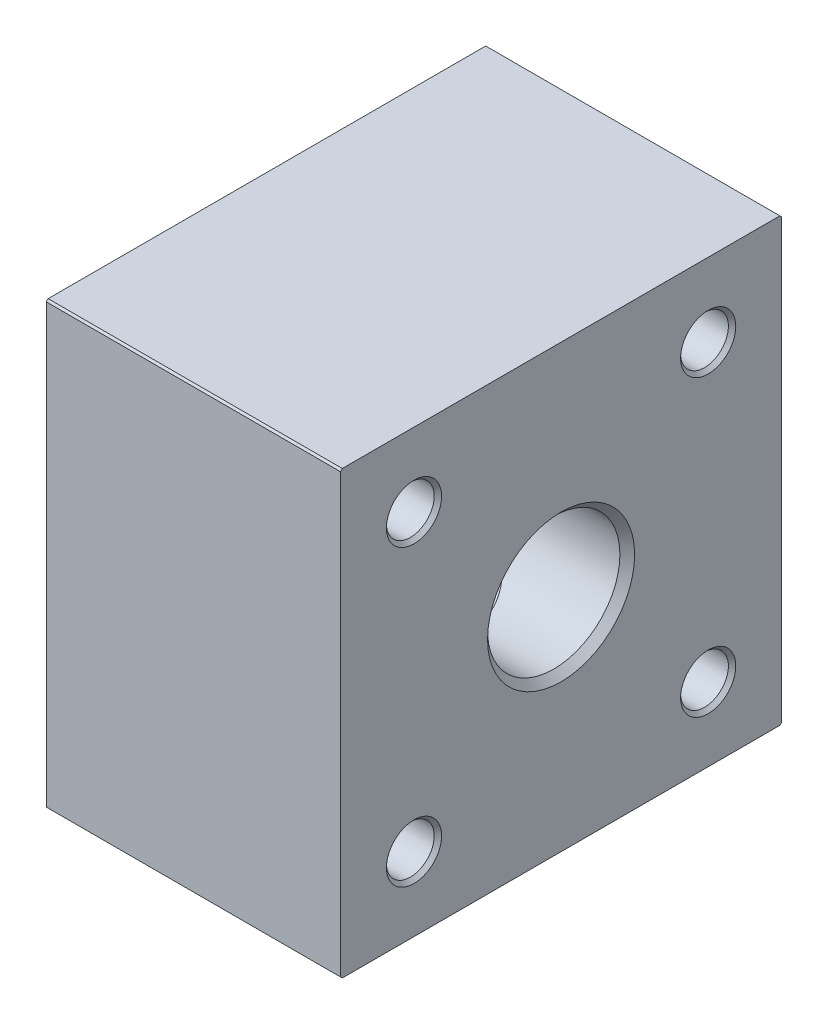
ISO-10303-21;
HEADER;
FILE_DESCRIPTION(('STEP AP214'),'2;1');
FILE_NAME('part.step','',(''),(''),'','','');
FILE_SCHEMA(('AUTOMOTIVE_DESIGN { 1 0 10303 214 1 1 1 1 }'));
ENDSEC;
DATA;
#1=APPLICATION_CONTEXT('core data for automotive mechanical design processes');
#2=APPLICATION_PROTOCOL_DEFINITION('international standard','automotive_design',2000,#1);
#3=PRODUCT_CONTEXT('',#1,'mechanical');
#4=PRODUCT('Part','Part','',(#3));
#5=PRODUCT_RELATED_PRODUCT_CATEGORY('part','',(#4));
#6=PRODUCT_DEFINITION_FORMATION('','',#4);
#7=PRODUCT_DEFINITION_CONTEXT('part definition',#1,'design');
#8=PRODUCT_DEFINITION('design','',#6,#7);
#9=PRODUCT_DEFINITION_SHAPE('','',#8);
#10=(LENGTH_UNIT() NAMED_UNIT(*) SI_UNIT(.MILLI.,.METRE.));
#11=(NAMED_UNIT(*) PLANE_ANGLE_UNIT() SI_UNIT($,.RADIAN.));
#12=(NAMED_UNIT(*) SI_UNIT($,.STERADIAN.) SOLID_ANGLE_UNIT());
#13=UNCERTAINTY_MEASURE_WITH_UNIT(LENGTH_MEASURE(1.E-05),#10,'distance_accuracy_value','');
#14=(GEOMETRIC_REPRESENTATION_CONTEXT(3) GLOBAL_UNCERTAINTY_ASSIGNED_CONTEXT((#13)) GLOBAL_UNIT_ASSIGNED_CONTEXT((#10,
#11,#12)) REPRESENTATION_CONTEXT('',''));
#15=CARTESIAN_POINT('',(0.,0.,0.));
#16=DIRECTION('',(0.,0.,1.));
#17=DIRECTION('',(1.,0.,0.));
#18=AXIS2_PLACEMENT_3D('',#15,#16,#17);
#19=CARTESIAN_POINT('',(20.,2.662681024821,0.));
#20=DIRECTION('',(0.,-1.,0.));
#21=DIRECTION('',(0.,0.,-1.));
#22=AXIS2_PLACEMENT_3D('',#19,#20,#21);
#23=CYLINDRICAL_SURFACE('',#22,9.);
#24=CARTESIAN_POINT('',(13.9999999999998,-6.,6.70820393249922));
#25=CARTESIAN_POINT('',(13.9113244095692,-6.08867314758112,6.62888851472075));
#26=CARTESIAN_POINT('',(13.8236487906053,-6.17633203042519,6.54730546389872));
#27=CARTESIAN_POINT('',(13.6526013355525,-6.34733938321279,6.3815652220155));
#28=CARTESIAN_POINT('',(13.5691767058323,-6.43074081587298,6.29751708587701));
#29=CARTESIAN_POINT('',(13.4066489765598,-6.59323573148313,6.1270912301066));
#30=CARTESIAN_POINT('',(13.3274901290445,-6.67238464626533,6.04081965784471));
#31=CARTESIAN_POINT('',(13.1735026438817,-6.82637045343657,5.86618719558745));
#32=CARTESIAN_POINT('',(13.0986154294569,-6.90126548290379,5.77792930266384));
#33=CARTESIAN_POINT('',(12.9531673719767,-7.04674171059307,5.5995592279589));
#34=CARTESIAN_POINT('',(12.882545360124,-7.11738376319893,5.5095466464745));
#35=CARTESIAN_POINT('',(12.7456114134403,-7.25434911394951,5.32789449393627));
#36=CARTESIAN_POINT('',(12.6792359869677,-7.32073610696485,5.23635091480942));
#37=CARTESIAN_POINT('',(12.5531230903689,-7.44684596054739,5.05523934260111));
#38=CARTESIAN_POINT('',(12.4932278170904,-7.50672818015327,4.96589228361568));
#39=CARTESIAN_POINT('',(12.3770804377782,-7.6228518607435,4.78564256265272));
#40=CARTESIAN_POINT('',(12.3207809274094,-7.67914068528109,4.69480101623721));
#41=CARTESIAN_POINT('',(12.2118342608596,-7.78807409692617,4.51171901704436));
#42=CARTESIAN_POINT('',(12.159138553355,-7.84076708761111,4.4195363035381));
#43=CARTESIAN_POINT('',(12.0574028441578,-7.94250883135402,4.23392765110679));
#44=CARTESIAN_POINT('',(12.0083133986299,-7.99160681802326,4.14055584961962));
#45=CARTESIAN_POINT('',(11.9137867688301,-8.08615628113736,3.95272164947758));
#46=CARTESIAN_POINT('',(11.8682995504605,-8.13165768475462,3.85830960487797));
#47=CARTESIAN_POINT('',(11.7809684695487,-8.21901819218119,3.66854679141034));
#48=CARTESIAN_POINT('',(11.7390742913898,-8.26092758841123,3.57324238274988));
#49=CARTESIAN_POINT('',(11.6600741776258,-8.3399240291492,3.38461301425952));
#50=CARTESIAN_POINT('',(11.6228365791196,-8.37714427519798,3.2913990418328));
#51=CARTESIAN_POINT('',(11.5516044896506,-8.44831237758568,3.10395615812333));
#52=CARTESIAN_POINT('',(11.5175763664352,-8.48229422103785,3.00975295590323));
#53=CARTESIAN_POINT('',(11.4527804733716,-8.54699078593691,2.82044902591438));
#54=CARTESIAN_POINT('',(11.4219800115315,-8.57773828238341,2.72537070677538));
#55=CARTESIAN_POINT('',(11.3636515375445,-8.63596627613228,2.53443156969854));
#56=CARTESIAN_POINT('',(11.3360921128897,-8.66347813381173,2.43858992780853));
#57=CARTESIAN_POINT('',(11.2842538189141,-8.71523666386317,2.24623936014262));
#58=CARTESIAN_POINT('',(11.2599451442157,-8.73951299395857,2.14974646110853));
#59=CARTESIAN_POINT('',(11.2146122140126,-8.78480218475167,1.95620787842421));
#60=CARTESIAN_POINT('',(11.1935600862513,-8.80584272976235,1.85917521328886));
#61=CARTESIAN_POINT('',(11.1547400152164,-8.84466243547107,1.6646708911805));
#62=CARTESIAN_POINT('',(11.13694644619,-8.86246703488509,1.56720943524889));
#63=CARTESIAN_POINT('',(11.1046391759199,-8.89481719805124,1.37196039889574));
#64=CARTESIAN_POINT('',(11.0901023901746,-8.90938569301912,1.27418044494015));
#65=CARTESIAN_POINT('',(11.0643004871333,-8.93526619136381,1.07840616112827));
#66=CARTESIAN_POINT('',(11.0530150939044,-8.9465983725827,0.980417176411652));
#67=CARTESIAN_POINT('',(11.0337035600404,-8.9660092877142,0.784335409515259));
#68=CARTESIAN_POINT('',(11.0256601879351,-8.9741052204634,0.68624603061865));
#69=CARTESIAN_POINT('',(11.0128177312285,-8.98704593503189,0.490072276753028));
#70=CARTESIAN_POINT('',(11.008004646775,-8.99190474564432,0.391989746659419));
#71=CARTESIAN_POINT('',(11.0015995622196,-8.99837727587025,0.195938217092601));
#72=CARTESIAN_POINT('',(10.9999969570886,-9.00000167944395,0.0979699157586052));
#73=CARTESIAN_POINT('',(11.,-9.,0.));
#74=B_SPLINE_CURVE_WITH_KNOTS('',3,(#24,#25,#26,#27,#28,#29,#30,#31,#32,#33,#34,#35,#36,#37,#38,
#39,#40,#41,#42,#43,#44,#45,#46,#47,#48,#49,#50,#51,#52,#53,#54,#55,#56,#57,#58,#59,#60,#61,#62,
#63,#64,#65,#66,#67,#68,#69,#70,#71,#72,#73),.UNSPECIFIED.,.F.,.F.,(4,2,2,2,2,2,2,2,2,2,2,2,2,2,
2,2,2,2,2,2,2,2,2,2,4),(0.,0.445133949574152,0.87956523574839,1.30344601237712,1.71694008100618,
2.12022390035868,2.51348767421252,2.88272768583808,3.24500411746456,3.60052008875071,
3.94949052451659,4.2921426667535,4.6287165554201,4.94978932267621,5.26699866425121,
5.58059867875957,5.8908523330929,6.19803118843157,6.50241503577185,6.80429143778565,
7.10395517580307,7.40170760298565,7.6978559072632,7.9927122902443,8.28659307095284),.UNSPECIFIED.);
#75=CARTESIAN_POINT('',(13.9999999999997,-6.,6.70820393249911));
#76=VERTEX_POINT('',#75);
#77=CARTESIAN_POINT('',(11.,-9.,0.));
#78=VERTEX_POINT('',#77);
#79=EDGE_CURVE('P0_E88',#76,#78,#74,.T.);
#80=ORIENTED_EDGE('',*,*,#79,.T.);
#81=CARTESIAN_POINT('',(11.,-9.,0.));
#82=CARTESIAN_POINT('',(10.999996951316,-9.00000168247,-0.0980132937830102));
#83=CARTESIAN_POINT('',(11.0016009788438,-8.99837558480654,-0.19602496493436));
#84=CARTESIAN_POINT('',(11.0080117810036,-8.99189640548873,-0.392164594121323));
#85=CARTESIAN_POINT('',(11.0128292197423,-8.98703257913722,-0.490291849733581));
#86=CARTESIAN_POINT('',(11.0256834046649,-8.97407857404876,-0.68655626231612));
#87=CARTESIAN_POINT('',(11.0337342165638,-8.96597429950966,-0.784691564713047));
#88=CARTESIAN_POINT('',(11.0530637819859,-8.94654344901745,-0.980866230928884));
#89=CARTESIAN_POINT('',(11.0643598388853,-8.93519960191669,-1.07890217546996));
#90=CARTESIAN_POINT('',(11.0901863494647,-8.90929252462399,-1.27477126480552));
#91=CARTESIAN_POINT('',(11.1047371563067,-8.89470903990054,-1.37259904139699));
#92=CARTESIAN_POINT('',(11.1370758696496,-8.86232565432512,-1.56794443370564));
#93=CARTESIAN_POINT('',(11.154886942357,-8.84450274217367,-1.6654543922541));
#94=CARTESIAN_POINT('',(11.1937455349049,-8.80564317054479,-1.86005624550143));
#95=CARTESIAN_POINT('',(11.2148187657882,-8.78458098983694,-1.95713790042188));
#96=CARTESIAN_POINT('',(11.2601975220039,-8.7392452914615,-2.15077479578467));
#97=CARTESIAN_POINT('',(11.2845310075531,-8.71494400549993,-2.24731697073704));
#98=CARTESIAN_POINT('',(11.3364226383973,-8.66313232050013,-2.43976621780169));
#99=CARTESIAN_POINT('',(11.3640106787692,-8.63559217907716,-2.5356572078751));
#100=CARTESIAN_POINT('',(11.4224001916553,-8.57730440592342,-2.72669496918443));
#101=CARTESIAN_POINT('',(11.4532331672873,-8.54652532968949,-2.82182250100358));
#102=CARTESIAN_POINT('',(11.5180979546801,-8.48176227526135,-3.011224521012));
#103=CARTESIAN_POINT('',(11.552162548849,-8.4477454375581,-3.10547652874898));
#104=CARTESIAN_POINT('',(11.6234715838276,-8.376504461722,-3.29301662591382));
#105=CARTESIAN_POINT('',(11.6607497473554,-8.33924625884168,-3.38627892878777));
#106=CARTESIAN_POINT('',(11.7397888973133,-8.26021528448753,-3.57489229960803));
#107=CARTESIAN_POINT('',(11.781678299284,-8.21831255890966,-3.67013504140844));
#108=CARTESIAN_POINT('',(11.8689989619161,-8.13096419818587,-3.85978192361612));
#109=CARTESIAN_POINT('',(11.9144806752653,-8.08546809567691,-3.95413953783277));
#110=CARTESIAN_POINT('',(12.0089961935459,-7.99092849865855,-4.1418723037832));
#111=CARTESIAN_POINT('',(12.0580801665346,-7.94183492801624,-4.23519693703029));
#112=CARTESIAN_POINT('',(12.1598055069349,-7.84010114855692,-4.42071845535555));
#113=CARTESIAN_POINT('',(12.2124964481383,-7.78741157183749,-4.51286103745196));
#114=CARTESIAN_POINT('',(12.3214348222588,-7.67848407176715,-4.69586971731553));
#115=CARTESIAN_POINT('',(12.3777309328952,-7.62219762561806,-4.78667790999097));
#116=CARTESIAN_POINT('',(12.4938735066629,-7.50607802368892,-4.96686769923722));
#117=CARTESIAN_POINT('',(12.5537674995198,-7.44619740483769,-5.05618801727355));
#118=CARTESIAN_POINT('',(12.6798541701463,-7.32011505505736,-5.23721369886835));
#119=CARTESIAN_POINT('',(12.7462036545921,-7.25375501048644,-5.32869949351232));
#120=CARTESIAN_POINT('',(12.8830817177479,-7.11684692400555,-5.51023815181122));
#121=CARTESIAN_POINT('',(12.9536737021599,-7.04623525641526,-5.60019512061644));
#122=CARTESIAN_POINT('',(13.0990578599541,-6.90082345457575,-5.7784564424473));
#123=CARTESIAN_POINT('',(13.1739111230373,-6.82596254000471,-5.86666130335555));
#124=CARTESIAN_POINT('',(13.3278269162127,-6.67204854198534,-6.04119040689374));
#125=CARTESIAN_POINT('',(13.4069479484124,-6.59293739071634,-6.12741176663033));
#126=CARTESIAN_POINT('',(13.5693963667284,-6.43052160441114,-6.29774018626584));
#127=CARTESIAN_POINT('',(13.6527794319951,-6.34716160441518,-6.38174121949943));
#128=CARTESIAN_POINT('',(13.8237401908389,-6.1762407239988,-6.54739051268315));
#129=CARTESIAN_POINT('',(13.9113706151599,-6.08862694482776,-6.62892984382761));
#130=CARTESIAN_POINT('',(13.9999999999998,-6.,-6.70820393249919));
#131=B_SPLINE_CURVE_WITH_KNOTS('',3,(#81,#82,#83,#84,#85,#86,#87,#88,#89,#90,#91,#92,#93,#94,
#95,#96,#97,#98,#99,#100,#101,#102,#103,#104,#105,#106,#107,#108,#109,#110,#111,#112,#113,#114,
#115,#116,#117,#118,#119,#120,#121,#122,#123,#124,#125,#126,#127,#128,#129,#130),.UNSPECIFIED.,
.F.,.F.,(4,2,2,2,2,2,2,2,2,2,2,2,2,2,2,2,2,2,2,2,2,2,2,2,4),(0.,0.294010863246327,
0.589002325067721,0.88529119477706,1.1831901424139,1.48300680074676,1.78504294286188,
2.08959374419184,2.39694713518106,2.70738324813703,3.02117395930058,3.33858252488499,
3.65986330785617,3.99626743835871,4.33877185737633,4.68761636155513,5.04302791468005,
5.40522113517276,5.77439881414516,6.16746142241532,6.57053851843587,6.98381998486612,
7.40748198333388,7.84168804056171,8.28659005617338),.UNSPECIFIED.);
#132=CARTESIAN_POINT('',(13.9999999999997,-6.,-6.7082039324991));
#133=VERTEX_POINT('',#132);
#134=EDGE_CURVE('P0_E72',#78,#133,#131,.T.);
#135=ORIENTED_EDGE('',*,*,#134,.T.);
#136=CARTESIAN_POINT('',(20.,-6.,0.));
#137=DIRECTION('',(0.,-1.,0.));
#138=DIRECTION('',(0.,0.,-1.));
#139=AXIS2_PLACEMENT_3D('',#136,#137,#138);
#140=CIRCLE('',#139,9.);
#141=CARTESIAN_POINT('',(26.,-6.,-6.70820393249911));
#142=VERTEX_POINT('',#141);
#143=EDGE_CURVE('P0_E26',#133,#142,#140,.T.);
#144=ORIENTED_EDGE('',*,*,#143,.T.);
#145=CARTESIAN_POINT('',(26.0000000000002,-6.,-6.7082039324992));
#146=CARTESIAN_POINT('',(26.0886113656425,-6.08860893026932,-6.62894596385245));
#147=CARTESIAN_POINT('',(26.1762242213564,-6.17620501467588,-6.54742362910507));
#148=CARTESIAN_POINT('',(26.3471526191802,-6.34709312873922,-6.38180838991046));
#149=CARTESIAN_POINT('',(26.4305208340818,-6.43043800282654,-6.29782430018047));
#150=CARTESIAN_POINT('',(26.5929422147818,-6.5928261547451,-6.12752956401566));
#151=CARTESIAN_POINT('',(26.672050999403,-6.67192473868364,-6.04132483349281));
#152=CARTESIAN_POINT('',(26.8259448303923,-6.82581623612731,-5.86682854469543));
#153=CARTESIAN_POINT('',(26.9007883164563,-6.90066715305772,-5.77863976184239));
#154=CARTESIAN_POINT('',(27.0461553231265,-7.04606156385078,-5.60040990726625));
#155=CARTESIAN_POINT('',(27.11673986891,-7.11666576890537,-5.51046822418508));
#156=CARTESIAN_POINT('',(27.2536052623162,-7.25356166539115,-5.32895929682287));
#157=CARTESIAN_POINT('',(27.3199494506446,-7.31991690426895,-5.23748784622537));
#158=CARTESIAN_POINT('',(27.4460260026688,-7.44599019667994,-5.05649179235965));
#159=CARTESIAN_POINT('',(27.5059151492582,-7.50586653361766,-4.96718673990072));
#160=CARTESIAN_POINT('',(27.6220496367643,-7.62197876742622,-4.78702699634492));
#161=CARTESIAN_POINT('',(27.6783424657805,-7.67826209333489,-4.69623354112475));
#162=CARTESIAN_POINT('',(27.7872757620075,-7.78718466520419,-4.51325378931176));
#163=CARTESIAN_POINT('',(27.8399648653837,-7.83987239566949,-4.42112535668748));
#164=CARTESIAN_POINT('',(27.9416879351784,-7.94160376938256,-4.23563147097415));
#165=CARTESIAN_POINT('',(27.9907714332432,-7.99069674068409,-4.1423202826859));
#166=CARTESIAN_POINT('',(28.0852873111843,-8.0852364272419,-3.95461364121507));
#167=CARTESIAN_POINT('',(28.1307698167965,-8.13073317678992,-3.86026867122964));
#168=CARTESIAN_POINT('',(28.2180932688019,-8.21808415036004,-3.67064623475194));
#169=CARTESIAN_POINT('',(28.2599846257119,-8.25998879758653,-3.57541526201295));
#170=CARTESIAN_POINT('',(28.3390383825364,-8.33903439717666,-3.38680112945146));
#171=CARTESIAN_POINT('',(28.3763284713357,-8.37630456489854,-3.29352570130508));
#172=CARTESIAN_POINT('',(28.4476603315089,-8.44756838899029,-3.10595882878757));
#173=CARTESIAN_POINT('',(28.4817358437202,-8.48159612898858,-3.01169318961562));
#174=CARTESIAN_POINT('',(28.5466214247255,-8.54637993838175,-2.82226344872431));
#175=CARTESIAN_POINT('',(28.5774642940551,-8.57716888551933,-2.72712184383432));
#176=CARTESIAN_POINT('',(28.6358725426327,-8.63547534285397,-2.53605553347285));
#177=CARTESIAN_POINT('',(28.6634694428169,-8.66302431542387,-2.4401500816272));
#178=CARTESIAN_POINT('',(28.7153777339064,-8.71485260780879,-2.24767156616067));
#179=CARTESIAN_POINT('',(28.7397190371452,-8.73916168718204,-2.15111459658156));
#180=CARTESIAN_POINT('',(28.7851123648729,-8.78451191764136,-1.95744782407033));
#181=CARTESIAN_POINT('',(28.8061923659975,-8.80558085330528,-1.86035109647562));
#182=CARTESIAN_POINT('',(28.8450634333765,-8.84445288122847,-1.66571886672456));
#183=CARTESIAN_POINT('',(28.8628802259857,-8.86228150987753,-1.56819361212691));
#184=CARTESIAN_POINT('',(28.895229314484,-8.89467527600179,-1.37281745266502));
#185=CARTESIAN_POINT('',(28.909784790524,-8.9092634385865,-1.27497421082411));
#186=CARTESIAN_POINT('',(28.9356195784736,-8.93517882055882,-1.07907407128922));
#187=CARTESIAN_POINT('',(28.9469192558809,-8.9465263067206,-0.981022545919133));
#188=CARTESIAN_POINT('',(28.9662550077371,-8.96596338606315,-0.784816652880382));
#189=CARTESIAN_POINT('',(28.9743083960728,-8.9740702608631,-0.686665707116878));
#190=CARTESIAN_POINT('',(28.9871666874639,-8.9870284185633,-0.490369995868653));
#191=CARTESIAN_POINT('',(28.9919856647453,-8.9918938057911,-0.392227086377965));
#192=CARTESIAN_POINT('',(28.9983985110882,-8.9983750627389,-0.196056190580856));
#193=CARTESIAN_POINT('',(29.0000030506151,-9.00000168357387,-0.0980289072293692));
#194=CARTESIAN_POINT('',(29.,-9.,0.));
#195=B_SPLINE_CURVE_WITH_KNOTS('',3,(#145,#146,#147,#148,#149,#150,#151,#152,#153,#154,#155,
#156,#157,#158,#159,#160,#161,#162,#163,#164,#165,#166,#167,#168,#169,#170,#171,#172,#173,#174,
#175,#176,#177,#178,#179,#180,#181,#182,#183,#184,#185,#186,#187,#188,#189,#190,#191,#192,#193,
#194),.UNSPECIFIED.,.F.,.F.,(4,2,2,2,2,2,2,2,2,2,2,2,2,2,2,2,2,2,2,2,2,2,2,2,4),(0.,
0.444811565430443,0.878936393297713,1.30252630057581,1.71574471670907,2.11876768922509,
2.51178496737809,2.88091612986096,3.24306718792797,3.59844085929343,3.94725167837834,
4.2897265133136,4.62610505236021,4.94744500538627,5.26491100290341,5.5787575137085,
5.88924790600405,6.19665417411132,6.5012565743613,6.80334316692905,7.103209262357,
7.40115677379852,7.69749347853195,7.99253219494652,8.2865898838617),.UNSPECIFIED.);
#196=CARTESIAN_POINT('',(29.,-9.,0.));
#197=VERTEX_POINT('',#196);
#198=EDGE_CURVE('P0_E11',#142,#197,#195,.T.);
#199=ORIENTED_EDGE('',*,*,#198,.T.);
#200=CARTESIAN_POINT('',(29.,-9.,0.));
#201=CARTESIAN_POINT('',(29.0000030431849,-9.00000167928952,0.0979711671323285));
#202=CARTESIAN_POINT('',(28.9984003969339,-8.99837716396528,0.195940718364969));
#203=CARTESIAN_POINT('',(28.9919951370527,-8.99190421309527,0.391995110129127));
#204=CARTESIAN_POINT('',(28.9871819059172,-8.98704508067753,0.49007925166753));
#205=CARTESIAN_POINT('',(28.9743390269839,-8.97410352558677,0.686256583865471));
#206=CARTESIAN_POINT('',(28.9662953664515,-8.96600706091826,0.784347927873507));
#207=CARTESIAN_POINT('',(28.9469830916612,-8.94659488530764,0.980433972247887));
#208=CARTESIAN_POINT('',(28.9356972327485,-8.93526196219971,1.07842526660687));
#209=CARTESIAN_POINT('',(28.9098941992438,-8.90937978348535,1.27420450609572));
#210=CARTESIAN_POINT('',(28.8953567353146,-8.89481033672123,1.3719871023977));
#211=CARTESIAN_POINT('',(28.8630478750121,-8.86245807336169,1.56724174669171));
#212=CARTESIAN_POINT('',(28.8452533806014,-8.84465231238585,1.66470616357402));
#213=CARTESIAN_POINT('',(28.8064311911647,-8.80583008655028,1.85921671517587));
#214=CARTESIAN_POINT('',(28.7853778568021,-8.78478817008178,1.95625264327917));
#215=CARTESIAN_POINT('',(28.7400422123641,-8.73949603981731,2.14979804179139));
#216=CARTESIAN_POINT('',(28.7157320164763,-8.71521812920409,2.24629448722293));
#217=CARTESIAN_POINT('',(28.6638903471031,-8.66345623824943,2.43865241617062));
#218=CARTESIAN_POINT('',(28.6363290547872,-8.63594258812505,2.53449786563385));
#219=CARTESIAN_POINT('',(28.5779964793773,-8.57771082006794,2.72544486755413));
#220=CARTESIAN_POINT('',(28.5471937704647,-8.54696133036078,2.8205272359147));
#221=CARTESIAN_POINT('',(28.4823929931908,-8.48226054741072,3.00983947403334));
#222=CARTESIAN_POINT('',(28.4483622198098,-8.4482764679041,3.10404692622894));
#223=CARTESIAN_POINT('',(28.3771243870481,-8.37710381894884,3.291498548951));
#224=CARTESIAN_POINT('',(28.3398836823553,-8.33988125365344,3.38471700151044));
#225=CARTESIAN_POINT('',(28.2608834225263,-8.2608859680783,3.57333981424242));
#226=CARTESIAN_POINT('',(28.2189926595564,-8.21898049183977,3.66863356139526));
#227=CARTESIAN_POINT('',(28.1316678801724,-8.13162658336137,3.85837802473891));
#228=CARTESIAN_POINT('',(28.0861834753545,-8.08612777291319,3.95278230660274));
#229=CARTESIAN_POINT('',(27.9916616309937,-7.99158241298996,4.14060390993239));
#230=CARTESIAN_POINT('',(27.9425740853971,-7.94248586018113,4.23397080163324));
#231=CARTESIAN_POINT('',(27.8408410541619,-7.84074585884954,4.41957242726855));
#232=CARTESIAN_POINT('',(27.7881460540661,-7.78805310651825,4.51175294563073));
#233=CARTESIAN_POINT('',(27.679199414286,-7.67911901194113,4.69483318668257));
#234=CARTESIAN_POINT('',(27.6228991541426,-7.62282920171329,4.78567508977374));
#235=CARTESIAN_POINT('',(27.5067485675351,-7.50670253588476,4.96592805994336));
#236=CARTESIAN_POINT('',(27.4468507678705,-7.44681826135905,5.05527793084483));
#237=CARTESIAN_POINT('',(27.3207380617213,-7.32070972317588,5.2363870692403));
#238=CARTESIAN_POINT('',(27.254365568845,-7.2543263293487,5.32792571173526));
#239=CARTESIAN_POINT('',(27.1174371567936,-7.11736733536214,5.50956913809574));
#240=CARTESIAN_POINT('',(27.0468177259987,-7.04672800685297,5.59957788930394));
#241=CARTESIAN_POINT('',(26.9013743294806,-6.90125655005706,5.77794146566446));
#242=CARTESIAN_POINT('',(26.8264891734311,-6.82636354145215,5.86619665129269));
#243=CARTESIAN_POINT('',(26.6725052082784,-6.67238104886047,6.04082476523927));
#244=CARTESIAN_POINT('',(26.5933478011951,-6.59323340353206,6.12709465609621));
#245=CARTESIAN_POINT('',(26.4308222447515,-6.4307403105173,6.29751813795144));
#246=CARTESIAN_POINT('',(26.3473983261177,-6.34733940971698,6.38156554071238));
#247=CARTESIAN_POINT('',(26.1763514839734,-6.1763323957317,6.54730520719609));
#248=CARTESIAN_POINT('',(26.0886757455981,-6.08867330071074,6.62888837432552));
#249=CARTESIAN_POINT('',(26.0000000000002,-6.,6.70820393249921));
#250=B_SPLINE_CURVE_WITH_KNOTS('',3,(#200,#201,#202,#203,#204,#205,#206,#207,#208,#209,#210,
#211,#212,#213,#214,#215,#216,#217,#218,#219,#220,#221,#222,#223,#224,#225,#226,#227,#228,#229,
#230,#231,#232,#233,#234,#235,#236,#237,#238,#239,#240,#241,#242,#243,#244,#245,#246,#247,#248,
#249),.UNSPECIFIED.,.F.,.F.,(4,2,2,2,2,2,2,2,2,2,2,2,2,2,2,2,2,2,2,2,2,2,2,2,4),(0.,
0.293884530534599,0.588745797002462,0.884900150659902,1.18265982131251,1.48233202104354,
1.78421812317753,2.08861292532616,2.39580400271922,2.70607115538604,3.01968595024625,
3.33691135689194,3.65800147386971,3.99454000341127,4.33716645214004,4.68612086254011,
5.04163045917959,5.40391013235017,5.77316295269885,6.16640647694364,6.56967424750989,
6.98315647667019,7.40702962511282,7.84145749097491,8.28659222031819),.UNSPECIFIED.);
#251=CARTESIAN_POINT('',(26.,-6.,6.7082039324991));
#252=VERTEX_POINT('',#251);
#253=EDGE_CURVE('P0_E32',#197,#252,#250,.T.);
#254=ORIENTED_EDGE('',*,*,#253,.T.);
#255=CARTESIAN_POINT('',(20.,-6.,0.));
#256=DIRECTION('',(0.,-1.,0.));
#257=DIRECTION('',(0.,0.,-1.));
#258=AXIS2_PLACEMENT_3D('',#255,#256,#257);
#259=CIRCLE('',#258,9.);
#260=EDGE_CURVE('P0_E20',#252,#76,#259,.T.);
#261=ORIENTED_EDGE('',*,*,#260,.T.);
#262=EDGE_LOOP('',(#80,#135,#144,#199,#254,#261));
#263=FACE_BOUND('',#262,.T.);
#264=CARTESIAN_POINT('',(20.,-30.,0.));
#265=DIRECTION('',(0.,-1.,0.));
#266=DIRECTION('',(0.,0.,-1.));
#267=AXIS2_PLACEMENT_3D('',#264,#265,#266);
#268=CIRCLE('',#267,9.);
#269=CARTESIAN_POINT('',(20.,-30.,-9.));
#270=VERTEX_POINT('',#269);
#271=EDGE_CURVE('P0_E78',#270,#270,#268,.F.);
#272=ORIENTED_EDGE('',*,*,#271,.T.);
#273=EDGE_LOOP('',(#272));
#274=FACE_BOUND('',#273,.T.);
#275=ADVANCED_FACE('P0_F16',(#263,#274),#23,.T.);
#276=CARTESIAN_POINT('',(20.,-6.,0.));
#277=DIRECTION('',(0.,-1.,0.));
#278=DIRECTION('',(0.,0.,-1.));
#279=AXIS2_PLACEMENT_3D('',#276,#277,#278);
#280=PLANE('',#279);
#281=CARTESIAN_POINT('',(25.22015325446,-6.,-6.708203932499));
#282=CARTESIAN_POINT('',(24.1326310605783,-6.,-7.55427523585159));
#283=CARTESIAN_POINT('',(22.8341127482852,-6.,-8.01360124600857));
#284=CARTESIAN_POINT('',(22.1569387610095,-6.,-8.25313858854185));
#285=CARTESIAN_POINT('',(21.4481314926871,-6.,-8.37573370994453));
#286=CARTESIAN_POINT('',(20.7299248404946,-6.,-8.499954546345));
#287=CARTESIAN_POINT('',(20.0000000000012,-6.,-8.50000000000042));
#288=CARTESIAN_POINT('',(19.2711298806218,-6.,-8.50004538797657));
#289=CARTESIAN_POINT('',(18.5518685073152,-6.,-8.37573370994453));
#290=CARTESIAN_POINT('',(17.844070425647,-6.,-8.25340326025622));
#291=CARTESIAN_POINT('',(17.1658872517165,-6.,-8.01360124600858));
#292=CARTESIAN_POINT('',(15.8677854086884,-6.,-7.55459924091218));
#293=CARTESIAN_POINT('',(14.77984674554,-6.,-6.708203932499));
#294=B_SPLINE_CURVE_WITH_KNOTS('',2,(#281,#282,#283,#284,#285,#286,#287,#288,#289,#290,#291,
#292,#293),.UNSPECIFIED.,.F.,.F.,(3,2,2,2,2,2,3),(0.,0.25,0.375,0.5,0.625,0.75,1.),.UNSPECIFIED.);
#295=CARTESIAN_POINT('',(25.22015325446,-6.,-6.708203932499));
#296=VERTEX_POINT('',#295);
#297=CARTESIAN_POINT('',(14.77984674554,-6.,-6.708203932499));
#298=VERTEX_POINT('',#297);
#299=EDGE_CURVE('P0_E115',#296,#298,#294,.T.);
#300=ORIENTED_EDGE('',*,*,#299,.F.);
#301=DIRECTION('',(1.,0.,0.));
#302=VECTOR('',#301,1.);
#303=CARTESIAN_POINT('',(20.,-6.,-6.708203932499));
#304=LINE('',#303,#302);
#305=EDGE_CURVE('P0_E69',#142,#296,#304,.F.);
#306=ORIENTED_EDGE('',*,*,#305,.F.);
#307=ORIENTED_EDGE('',*,*,#143,.F.);
#308=DIRECTION('',(1.,0.,0.));
#309=VECTOR('',#308,1.);
#310=CARTESIAN_POINT('',(20.,-6.,-6.708203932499));
#311=LINE('',#310,#309);
#312=EDGE_CURVE('P0_E119',#298,#133,#311,.F.);
#313=ORIENTED_EDGE('',*,*,#312,.F.);
#314=EDGE_LOOP('',(#300,#306,#307,#313));
#315=FACE_BOUND('',#314,.T.);
#316=ADVANCED_FACE('P0_F101',(#315),#280,.F.);
#317=CARTESIAN_POINT('',(20.,-6.,0.));
#318=DIRECTION('',(0.,-1.,0.));
#319=DIRECTION('',(0.,0.,-1.));
#320=AXIS2_PLACEMENT_3D('',#317,#318,#319);
#321=PLANE('',#320);
#322=ORIENTED_EDGE('',*,*,#260,.F.);
#323=DIRECTION('',(1.,0.,0.));
#324=VECTOR('',#323,1.);
#325=CARTESIAN_POINT('',(20.,-6.,6.708203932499));
#326=LINE('',#325,#324);
#327=CARTESIAN_POINT('',(25.22015325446,-6.,6.708203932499));
#328=VERTEX_POINT('',#327);
#329=EDGE_CURVE('P0_E57',#328,#252,#326,.T.);
#330=ORIENTED_EDGE('',*,*,#329,.F.);
#331=CARTESIAN_POINT('',(14.77984674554,-6.,6.708203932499));
#332=CARTESIAN_POINT('',(15.867368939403,-6.,7.55427523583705));
#333=CARTESIAN_POINT('',(17.1658872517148,-6.,8.01360124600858));
#334=CARTESIAN_POINT('',(17.8430612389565,-6.,8.25313858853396));
#335=CARTESIAN_POINT('',(18.5518685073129,-6.,8.37573370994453));
#336=CARTESIAN_POINT('',(19.2700751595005,-6.,8.4999545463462));
#337=CARTESIAN_POINT('',(19.9999999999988,-6.,8.50000000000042));
#338=CARTESIAN_POINT('',(20.728870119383,-6.,8.50004538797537));
#339=CARTESIAN_POINT('',(21.4481314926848,-6.,8.37573370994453));
#340=CARTESIAN_POINT('',(22.155929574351,-6.,8.25340326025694));
#341=CARTESIAN_POINT('',(22.8341127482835,-6.,8.01360124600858));
#342=CARTESIAN_POINT('',(24.1322145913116,-6.,7.55459924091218));
#343=CARTESIAN_POINT('',(25.22015325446,-6.,6.708203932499));
#344=B_SPLINE_CURVE_WITH_KNOTS('',2,(#331,#332,#333,#334,#335,#336,#337,#338,#339,#340,#341,
#342,#343),.UNSPECIFIED.,.F.,.F.,(3,2,2,2,2,2,3),(0.,0.25,0.375,0.5,0.625,0.75,1.),.UNSPECIFIED.);
#345=CARTESIAN_POINT('',(14.77984674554,-6.,6.708203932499));
#346=VERTEX_POINT('',#345);
#347=EDGE_CURVE('P0_E54',#346,#328,#344,.T.);
#348=ORIENTED_EDGE('',*,*,#347,.F.);
#349=DIRECTION('',(1.,0.,0.));
#350=VECTOR('',#349,1.);
#351=CARTESIAN_POINT('',(20.,-6.,6.708203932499));
#352=LINE('',#351,#350);
#353=EDGE_CURVE('P0_E62',#76,#346,#352,.T.);
#354=ORIENTED_EDGE('',*,*,#353,.F.);
#355=EDGE_LOOP('',(#322,#330,#348,#354));
#356=FACE_BOUND('',#355,.T.);
#357=ADVANCED_FACE('P0_F17',(#356),#321,.F.);
#358=OPEN_SHELL('',(#275,#316,#357));
#359=SHELL_BASED_SURFACE_MODEL('P0_B1',(#358));
#360=CARTESIAN_POINT('',(40.,0.,0.));
#361=DIRECTION('',(1.,0.,0.));
#362=DIRECTION('',(0.,0.,-1.));
#363=AXIS2_PLACEMENT_3D('',#360,#361,#362);
#364=CYLINDRICAL_SURFACE('',#363,10.);
#365=CARTESIAN_POINT('',(20.,0.,0.));
#366=DIRECTION('',(1.,0.,0.));
#367=DIRECTION('',(0.,0.,-1.));
#368=AXIS2_PLACEMENT_3D('',#365,#366,#367);
#369=CIRCLE('',#368,10.);
#370=CARTESIAN_POINT('',(20.,0.,-10.));
#371=VERTEX_POINT('',#370);
#372=EDGE_CURVE('P1_E20',#371,#371,#369,.T.);
#373=ORIENTED_EDGE('',*,*,#372,.T.);
#374=EDGE_LOOP('',(#373));
#375=FACE_BOUND('',#374,.T.);
#376=CARTESIAN_POINT('',(40.,0.,0.));
#377=DIRECTION('',(1.,0.,0.));
#378=DIRECTION('',(0.,0.,-1.));
#379=AXIS2_PLACEMENT_3D('',#376,#377,#378);
#380=CIRCLE('',#379,10.);
#381=CARTESIAN_POINT('',(40.,0.,-10.));
#382=VERTEX_POINT('',#381);
#383=EDGE_CURVE('P1_E11',#382,#382,#380,.F.);
#384=ORIENTED_EDGE('',*,*,#383,.T.);
#385=EDGE_LOOP('',(#384));
#386=FACE_BOUND('',#385,.T.);
#387=ADVANCED_FACE('P1_F16',(#375,#386),#364,.T.);
#388=CARTESIAN_POINT('',(20.,0.,0.));
#389=DIRECTION('',(1.,0.,0.));
#390=DIRECTION('',(0.,0.,-1.));
#391=AXIS2_PLACEMENT_3D('',#388,#389,#390);
#392=PLANE('',#391);
#393=CARTESIAN_POINT('',(20.,-9.,0.));
#394=CARTESIAN_POINT('',(20.,-8.99990265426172,0.825985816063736));
#395=CARTESIAN_POINT('',(20.,-8.84974831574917,1.63766747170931));
#396=CARTESIAN_POINT('',(20.,-8.6905594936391,2.49818637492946));
#397=CARTESIAN_POINT('',(20.,-8.36809470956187,3.31285238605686));
#398=CARTESIAN_POINT('',(20.,-8.03248230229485,4.1607341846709));
#399=CARTESIAN_POINT('',(20.,-7.53295960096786,4.92488778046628));
#400=CARTESIAN_POINT('',(20.,-7.02331003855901,5.70453311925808));
#401=CARTESIAN_POINT('',(20.,-6.36396103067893,6.36396103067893));
#402=CARTESIAN_POINT('',(20.,-5.70536941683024,7.02263145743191));
#403=CARTESIAN_POINT('',(20.,-4.92488778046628,7.53295960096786));
#404=CARTESIAN_POINT('',(20.,-4.16167124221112,8.03199873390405));
#405=CARTESIAN_POINT('',(20.,-3.31285238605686,8.36809470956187));
#406=CARTESIAN_POINT('',(20.,-2.4991952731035,8.69026813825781));
#407=CARTESIAN_POINT('',(20.,-1.63766747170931,8.84974831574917));
#408=CARTESIAN_POINT('',(20.,-0.826255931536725,8.99995131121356));
#409=CARTESIAN_POINT('',(20.,0.,9.));
#410=CARTESIAN_POINT('',(20.,0.825196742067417,9.00004862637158));
#411=CARTESIAN_POINT('',(20.,1.6376674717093,8.84974831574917));
#412=CARTESIAN_POINT('',(20.,2.49818637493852,8.69055949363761));
#413=CARTESIAN_POINT('',(20.,3.31285238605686,8.36809470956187));
#414=CARTESIAN_POINT('',(20.,4.16073418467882,8.03248230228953));
#415=CARTESIAN_POINT('',(20.,4.92488778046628,7.53295960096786));
#416=CARTESIAN_POINT('',(20.,5.70453311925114,7.02331003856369));
#417=CARTESIAN_POINT('',(20.,6.36396103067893,6.36396103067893));
#418=CARTESIAN_POINT('',(20.,7.02263145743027,5.70536941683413));
#419=CARTESIAN_POINT('',(20.,7.53295960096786,4.92488778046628));
#420=CARTESIAN_POINT('',(20.,8.03199873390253,4.1616712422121));
#421=CARTESIAN_POINT('',(20.,8.36809470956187,3.31285238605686));
#422=CARTESIAN_POINT('',(20.,8.69026813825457,2.49919527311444));
#423=CARTESIAN_POINT('',(20.,8.84974831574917,1.63766747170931));
#424=CARTESIAN_POINT('',(20.,8.99990259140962,0.826519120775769));
#425=CARTESIAN_POINT('',(20.,9.,0.));
#426=B_SPLINE_CURVE_WITH_KNOTS('',2,(#393,#394,#395,#396,#397,#398,#399,#400,#401,#402,#403,
#404,#405,#406,#407,#408,#409,#410,#411,#412,#413,#414,#415,#416,#417,#418,#419,#420,#421,#422,
#423,#424,#425),.UNSPECIFIED.,.F.,.F.,(3,2,2,2,2,2,2,2,2,2,2,2,2,2,2,2,3),(0.,0.0625,0.125,
0.1875,0.25,0.3125,0.375,0.4375,0.5,0.5625,0.625,0.6875,0.75,0.8125,0.875,0.9375,1.),.UNSPECIFIED.);
#427=CARTESIAN_POINT('',(20.,-9.,0.));
#428=VERTEX_POINT('',#427);
#429=CARTESIAN_POINT('',(20.,9.,0.));
#430=VERTEX_POINT('',#429);
#431=EDGE_CURVE('P1_E28',#428,#430,#426,.T.);
#432=ORIENTED_EDGE('',*,*,#431,.F.);
#433=CARTESIAN_POINT('',(20.,9.,0.));
#434=CARTESIAN_POINT('',(20.,8.99990265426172,-0.825985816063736));
#435=CARTESIAN_POINT('',(20.,8.84974831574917,-1.63766747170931));
#436=CARTESIAN_POINT('',(20.,8.6905594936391,-2.49818637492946));
#437=CARTESIAN_POINT('',(20.,8.36809470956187,-3.31285238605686));
#438=CARTESIAN_POINT('',(20.,8.03248230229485,-4.1607341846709));
#439=CARTESIAN_POINT('',(20.,7.53295960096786,-4.92488778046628));
#440=CARTESIAN_POINT('',(20.,7.02331003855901,-5.70453311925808));
#441=CARTESIAN_POINT('',(20.,6.36396103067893,-6.36396103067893));
#442=CARTESIAN_POINT('',(20.,5.70536941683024,-7.02263145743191));
#443=CARTESIAN_POINT('',(20.,4.92488778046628,-7.53295960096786));
#444=CARTESIAN_POINT('',(20.,4.16167124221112,-8.03199873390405));
#445=CARTESIAN_POINT('',(20.,3.31285238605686,-8.36809470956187));
#446=CARTESIAN_POINT('',(20.,2.4991952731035,-8.69026813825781));
#447=CARTESIAN_POINT('',(20.,1.63766747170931,-8.84974831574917));
#448=CARTESIAN_POINT('',(20.,0.826255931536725,-8.99995131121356));
#449=CARTESIAN_POINT('',(20.,0.,-9.));
#450=CARTESIAN_POINT('',(20.,-0.825196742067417,-9.00004862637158));
#451=CARTESIAN_POINT('',(20.,-1.6376674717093,-8.84974831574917));
#452=CARTESIAN_POINT('',(20.,-2.49818637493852,-8.69055949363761));
#453=CARTESIAN_POINT('',(20.,-3.31285238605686,-8.36809470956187));
#454=CARTESIAN_POINT('',(20.,-4.16073418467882,-8.03248230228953));
#455=CARTESIAN_POINT('',(20.,-4.92488778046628,-7.53295960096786));
#456=CARTESIAN_POINT('',(20.,-5.70453311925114,-7.02331003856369));
#457=CARTESIAN_POINT('',(20.,-6.36396103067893,-6.36396103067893));
#458=CARTESIAN_POINT('',(20.,-7.02263145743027,-5.70536941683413));
#459=CARTESIAN_POINT('',(20.,-7.53295960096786,-4.92488778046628));
#460=CARTESIAN_POINT('',(20.,-8.03199873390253,-4.1616712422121));
#461=CARTESIAN_POINT('',(20.,-8.36809470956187,-3.31285238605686));
#462=CARTESIAN_POINT('',(20.,-8.69026813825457,-2.49919527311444));
#463=CARTESIAN_POINT('',(20.,-8.84974831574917,-1.63766747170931));
#464=CARTESIAN_POINT('',(20.,-8.99990259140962,-0.826519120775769));
#465=CARTESIAN_POINT('',(20.,-9.,0.));
#466=B_SPLINE_CURVE_WITH_KNOTS('',2,(#433,#434,#435,#436,#437,#438,#439,#440,#441,#442,#443,
#444,#445,#446,#447,#448,#449,#450,#451,#452,#453,#454,#455,#456,#457,#458,#459,#460,#461,#462,
#463,#464,#465),.UNSPECIFIED.,.F.,.F.,(3,2,2,2,2,2,2,2,2,2,2,2,2,2,2,2,3),(0.,0.0625,0.125,
0.1875,0.25,0.3125,0.375,0.4375,0.5,0.5625,0.625,0.6875,0.75,0.8125,0.875,0.9375,1.),.UNSPECIFIED.);
#467=EDGE_CURVE('P1_E33',#430,#428,#466,.T.);
#468=ORIENTED_EDGE('',*,*,#467,.F.);
#469=EDGE_LOOP('',(#432,#468));
#470=FACE_BOUND('',#469,.T.);
#471=ORIENTED_EDGE('',*,*,#372,.F.);
#472=EDGE_LOOP('',(#471));
#473=FACE_BOUND('',#472,.T.);
#474=ADVANCED_FACE('P1_F17',(#470,#473),#392,.F.);
#475=OPEN_SHELL('',(#387,#474));
#476=SHELL_BASED_SURFACE_MODEL('P1_B1',(#475));
#477=CARTESIAN_POINT('',(20.,29.875,-29.875));
#478=DIRECTION('',(0.,0.707106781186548,-0.707106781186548));
#479=DIRECTION('',(0.,0.707106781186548,0.707106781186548));
#480=AXIS2_PLACEMENT_3D('',#477,#478,#479);
#481=PLANE('',#480);
#482=DIRECTION('',(-1.,0.,0.));
#483=VECTOR('',#482,1.);
#484=CARTESIAN_POINT('',(0.,29.75,-30.));
#485=LINE('',#484,#483);
#486=CARTESIAN_POINT('',(0.,29.75,-30.));
#487=VERTEX_POINT('',#486);
#488=CARTESIAN_POINT('',(40.,29.75,-30.));
#489=VERTEX_POINT('',#488);
#490=EDGE_CURVE('P2_E252',#487,#489,#485,.F.);
#491=ORIENTED_EDGE('',*,*,#490,.F.);
#492=DIRECTION('',(0.,0.707106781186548,0.707106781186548));
#493=VECTOR('',#492,1.);
#494=CARTESIAN_POINT('',(0.,29.875,-29.875));
#495=LINE('',#494,#493);
#496=CARTESIAN_POINT('',(0.,30.,-29.75));
#497=VERTEX_POINT('',#496);
#498=EDGE_CURVE('P2_E274',#487,#497,#495,.T.);
#499=ORIENTED_EDGE('',*,*,#498,.T.);
#500=DIRECTION('',(1.,0.,0.));
#501=VECTOR('',#500,1.);
#502=CARTESIAN_POINT('',(0.,30.,-29.75));
#503=LINE('',#502,#501);
#504=CARTESIAN_POINT('',(40.,30.,-29.75));
#505=VERTEX_POINT('',#504);
#506=EDGE_CURVE('P2_E239',#505,#497,#503,.F.);
#507=ORIENTED_EDGE('',*,*,#506,.F.);
#508=DIRECTION('',(0.,0.707106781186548,0.707106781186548));
#509=VECTOR('',#508,1.);
#510=CARTESIAN_POINT('',(40.,29.75,-30.));
#511=LINE('',#510,#509);
#512=EDGE_CURVE('P2_E270',#489,#505,#511,.T.);
#513=ORIENTED_EDGE('',*,*,#512,.F.);
#514=EDGE_LOOP('',(#491,#499,#507,#513));
#515=FACE_BOUND('',#514,.T.);
#516=ADVANCED_FACE('P2_F16',(#515),#481,.T.);
#517=CARTESIAN_POINT('',(20.,29.875,29.875));
#518=DIRECTION('',(0.,0.707106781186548,0.707106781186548));
#519=DIRECTION('',(0.,-0.707106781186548,0.707106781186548));
#520=AXIS2_PLACEMENT_3D('',#517,#518,#519);
#521=PLANE('',#520);
#522=DIRECTION('',(1.,0.,0.));
#523=VECTOR('',#522,1.);
#524=CARTESIAN_POINT('',(0.,30.,29.75));
#525=LINE('',#524,#523);
#526=CARTESIAN_POINT('',(0.,30.,29.75));
#527=VERTEX_POINT('',#526);
#528=CARTESIAN_POINT('',(40.,30.,29.75));
#529=VERTEX_POINT('',#528);
#530=EDGE_CURVE('P2_E245',#527,#529,#525,.T.);
#531=ORIENTED_EDGE('',*,*,#530,.F.);
#532=DIRECTION('',(0.,-0.707106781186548,0.707106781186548));
#533=VECTOR('',#532,1.);
#534=CARTESIAN_POINT('',(0.,29.875,29.875));
#535=LINE('',#534,#533);
#536=CARTESIAN_POINT('',(0.,29.75,30.));
#537=VERTEX_POINT('',#536);
#538=EDGE_CURVE('P2_E272',#527,#537,#535,.T.);
#539=ORIENTED_EDGE('',*,*,#538,.T.);
#540=DIRECTION('',(1.,0.,0.));
#541=VECTOR('',#540,1.);
#542=CARTESIAN_POINT('',(0.,29.75,30.));
#543=LINE('',#542,#541);
#544=CARTESIAN_POINT('',(40.,29.75,30.));
#545=VERTEX_POINT('',#544);
#546=EDGE_CURVE('P2_E217',#545,#537,#543,.F.);
#547=ORIENTED_EDGE('',*,*,#546,.F.);
#548=DIRECTION('',(0.,-0.707106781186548,0.707106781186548));
#549=VECTOR('',#548,1.);
#550=CARTESIAN_POINT('',(40.,30.,29.75));
#551=LINE('',#550,#549);
#552=EDGE_CURVE('P2_E268',#529,#545,#551,.T.);
#553=ORIENTED_EDGE('',*,*,#552,.F.);
#554=EDGE_LOOP('',(#531,#539,#547,#553));
#555=FACE_BOUND('',#554,.T.);
#556=ADVANCED_FACE('P2_F313',(#555),#521,.T.);
#557=CARTESIAN_POINT('',(40.,0.,0.));
#558=DIRECTION('',(1.,0.,0.));
#559=DIRECTION('',(0.,0.,-1.));
#560=AXIS2_PLACEMENT_3D('',#557,#558,#559);
#561=PLANE('',#560);
#562=CARTESIAN_POINT('',(40.0000000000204,-20.,20.));
#563=DIRECTION('',(1.,0.,0.));
#564=DIRECTION('',(0.,0.,-1.));
#565=AXIS2_PLACEMENT_3D('',#562,#563,#564);
#566=CIRCLE('',#565,3.74999999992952);
#567=CARTESIAN_POINT('',(40.0000000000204,-20.,16.2500000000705));
#568=VERTEX_POINT('',#567);
#569=EDGE_CURVE('P2_E298',#568,#568,#566,.F.);
#570=ORIENTED_EDGE('',*,*,#569,.T.);
#571=EDGE_LOOP('',(#570));
#572=FACE_BOUND('',#571,.T.);
#573=CARTESIAN_POINT('',(40.0000000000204,20.,20.));
#574=DIRECTION('',(1.,0.,0.));
#575=DIRECTION('',(0.,0.,-1.));
#576=AXIS2_PLACEMENT_3D('',#573,#574,#575);
#577=CIRCLE('',#576,3.74999999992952);
#578=CARTESIAN_POINT('',(40.0000000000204,20.,16.2500000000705));
#579=VERTEX_POINT('',#578);
#580=EDGE_CURVE('P2_E111',#579,#579,#577,.F.);
#581=ORIENTED_EDGE('',*,*,#580,.T.);
#582=EDGE_LOOP('',(#581));
#583=FACE_BOUND('',#582,.T.);
#584=CARTESIAN_POINT('',(40.0000000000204,20.,-20.));
#585=DIRECTION('',(1.,0.,0.));
#586=DIRECTION('',(0.,0.,-1.));
#587=AXIS2_PLACEMENT_3D('',#584,#585,#586);
#588=CIRCLE('',#587,3.74999999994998);
#589=CARTESIAN_POINT('',(40.0000000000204,20.,-23.74999999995));
#590=VERTEX_POINT('',#589);
#591=EDGE_CURVE('P2_E300',#590,#590,#588,.F.);
#592=ORIENTED_EDGE('',*,*,#591,.T.);
#593=EDGE_LOOP('',(#592));
#594=FACE_BOUND('',#593,.T.);
#595=CARTESIAN_POINT('',(40.0000000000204,-20.,-20.));
#596=DIRECTION('',(1.,0.,0.));
#597=DIRECTION('',(0.,0.,-1.));
#598=AXIS2_PLACEMENT_3D('',#595,#596,#597);
#599=CIRCLE('',#598,3.74999999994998);
#600=CARTESIAN_POINT('',(40.0000000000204,-20.,-23.74999999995));
#601=VERTEX_POINT('',#600);
#602=EDGE_CURVE('P2_E19',#601,#601,#599,.F.);
#603=ORIENTED_EDGE('',*,*,#602,.T.);
#604=EDGE_LOOP('',(#603));
#605=FACE_BOUND('',#604,.T.);
#606=CARTESIAN_POINT('',(39.9999999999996,0.,0.));
#607=DIRECTION('',(1.,0.,0.));
#608=DIRECTION('',(0.,0.,-1.));
#609=AXIS2_PLACEMENT_3D('',#606,#607,#608);
#610=CIRCLE('',#609,10.0000000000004);
#611=CARTESIAN_POINT('',(39.9999999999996,0.,-10.0000000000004));
#612=VERTEX_POINT('',#611);
#613=EDGE_CURVE('P2_E110',#612,#612,#610,.F.);
#614=ORIENTED_EDGE('',*,*,#613,.T.);
#615=EDGE_LOOP('',(#614));
#616=FACE_BOUND('',#615,.T.);
#617=DIRECTION('',(0.,0.,-1.));
#618=VECTOR('',#617,1.);
#619=CARTESIAN_POINT('',(40.,-30.,30.));
#620=LINE('',#619,#618);
#621=CARTESIAN_POINT('',(40.,-30.,-29.75));
#622=VERTEX_POINT('',#621);
#623=CARTESIAN_POINT('',(40.,-30.,29.75));
#624=VERTEX_POINT('',#623);
#625=EDGE_CURVE('P2_E216',#622,#624,#620,.F.);
#626=ORIENTED_EDGE('',*,*,#625,.F.);
#627=DIRECTION('',(0.,0.707106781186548,-0.707106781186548));
#628=VECTOR('',#627,1.);
#629=CARTESIAN_POINT('',(40.,-29.875,-29.875));
#630=LINE('',#629,#628);
#631=CARTESIAN_POINT('',(40.,-29.75,-30.));
#632=VERTEX_POINT('',#631);
#633=EDGE_CURVE('P2_E206',#632,#622,#630,.F.);
#634=ORIENTED_EDGE('',*,*,#633,.F.);
#635=DIRECTION('',(0.,1.,0.));
#636=VECTOR('',#635,1.);
#637=CARTESIAN_POINT('',(40.,-30.,-30.));
#638=LINE('',#637,#636);
#639=EDGE_CURVE('P2_E250',#489,#632,#638,.F.);
#640=ORIENTED_EDGE('',*,*,#639,.F.);
#641=ORIENTED_EDGE('',*,*,#512,.T.);
#642=DIRECTION('',(0.,0.,1.));
#643=VECTOR('',#642,1.);
#644=CARTESIAN_POINT('',(40.,30.,-30.));
#645=LINE('',#644,#643);
#646=EDGE_CURVE('P2_E242',#529,#505,#645,.F.);
#647=ORIENTED_EDGE('',*,*,#646,.F.);
#648=ORIENTED_EDGE('',*,*,#552,.T.);
#649=DIRECTION('',(0.,1.,0.));
#650=VECTOR('',#649,1.);
#651=CARTESIAN_POINT('',(40.,30.,30.));
#652=LINE('',#651,#650);
#653=CARTESIAN_POINT('',(40.,-29.75,30.));
#654=VERTEX_POINT('',#653);
#655=EDGE_CURVE('P2_E237',#654,#545,#652,.T.);
#656=ORIENTED_EDGE('',*,*,#655,.F.);
#657=DIRECTION('',(0.,-0.707106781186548,-0.707106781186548));
#658=VECTOR('',#657,1.);
#659=CARTESIAN_POINT('',(40.,-29.875,29.875));
#660=LINE('',#659,#658);
#661=EDGE_CURVE('P2_E207',#624,#654,#660,.F.);
#662=ORIENTED_EDGE('',*,*,#661,.F.);
#663=EDGE_LOOP('',(#626,#634,#640,#641,#647,#648,#656,#662));
#664=FACE_BOUND('',#663,.T.);
#665=ADVANCED_FACE('P2_F310',(#572,#583,#594,#605,#616,#664),#561,.T.);
#666=CARTESIAN_POINT('',(20.,-29.875,29.875));
#667=DIRECTION('',(0.,-0.707106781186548,0.707106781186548));
#668=DIRECTION('',(0.,-0.707106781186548,-0.707106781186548));
#669=AXIS2_PLACEMENT_3D('',#666,#667,#668);
#670=PLANE('',#669);
#671=DIRECTION('',(1.,0.,0.));
#672=VECTOR('',#671,1.);
#673=CARTESIAN_POINT('',(0.,-29.75,30.));
#674=LINE('',#673,#672);
#675=CARTESIAN_POINT('',(0.,-29.75,30.));
#676=VERTEX_POINT('',#675);
#677=EDGE_CURVE('P2_E210',#676,#654,#674,.T.);
#678=ORIENTED_EDGE('',*,*,#677,.F.);
#679=DIRECTION('',(0.,-0.707106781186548,-0.707106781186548));
#680=VECTOR('',#679,1.);
#681=CARTESIAN_POINT('',(0.,-29.875,29.875));
#682=LINE('',#681,#680);
#683=CARTESIAN_POINT('',(0.,-30.,29.75));
#684=VERTEX_POINT('',#683);
#685=EDGE_CURVE('P2_E34',#676,#684,#682,.T.);
#686=ORIENTED_EDGE('',*,*,#685,.T.);
#687=DIRECTION('',(1.,0.,0.));
#688=VECTOR('',#687,1.);
#689=CARTESIAN_POINT('',(0.,-30.,29.75));
#690=LINE('',#689,#688);
#691=EDGE_CURVE('P2_E233',#624,#684,#690,.F.);
#692=ORIENTED_EDGE('',*,*,#691,.F.);
#693=ORIENTED_EDGE('',*,*,#661,.T.);
#694=EDGE_LOOP('',(#678,#686,#692,#693));
#695=FACE_BOUND('',#694,.T.);
#696=ADVANCED_FACE('P2_F211',(#695),#670,.T.);
#697=CARTESIAN_POINT('',(20.,-29.875,-29.875));
#698=DIRECTION('',(0.,-0.707106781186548,-0.707106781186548));
#699=DIRECTION('',(0.,0.707106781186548,-0.707106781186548));
#700=AXIS2_PLACEMENT_3D('',#697,#698,#699);
#701=PLANE('',#700);
#702=DIRECTION('',(1.,0.,0.));
#703=VECTOR('',#702,1.);
#704=CARTESIAN_POINT('',(0.,-30.,-29.75));
#705=LINE('',#704,#703);
#706=CARTESIAN_POINT('',(0.,-30.,-29.75));
#707=VERTEX_POINT('',#706);
#708=EDGE_CURVE('P2_E230',#707,#622,#705,.T.);
#709=ORIENTED_EDGE('',*,*,#708,.F.);
#710=DIRECTION('',(0.,0.707106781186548,-0.707106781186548));
#711=VECTOR('',#710,1.);
#712=CARTESIAN_POINT('',(0.,-29.875,-29.875));
#713=LINE('',#712,#711);
#714=CARTESIAN_POINT('',(0.,-29.75,-30.));
#715=VERTEX_POINT('',#714);
#716=EDGE_CURVE('P2_E264',#707,#715,#713,.T.);
#717=ORIENTED_EDGE('',*,*,#716,.T.);
#718=DIRECTION('',(-1.,0.,0.));
#719=VECTOR('',#718,1.);
#720=CARTESIAN_POINT('',(0.,-29.75,-30.));
#721=LINE('',#720,#719);
#722=EDGE_CURVE('P2_E247',#632,#715,#721,.T.);
#723=ORIENTED_EDGE('',*,*,#722,.F.);
#724=ORIENTED_EDGE('',*,*,#633,.T.);
#725=EDGE_LOOP('',(#709,#717,#723,#724));
#726=FACE_BOUND('',#725,.T.);
#727=ADVANCED_FACE('P2_F322',(#726),#701,.T.);
#728=CARTESIAN_POINT('',(20.,-29.9999999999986,0.));
#729=DIRECTION('',(0.,-1.,0.));
#730=DIRECTION('',(0.,0.,-1.));
#731=AXIS2_PLACEMENT_3D('',#728,#729,#730);
#732=CONICAL_SURFACE('',#731,9.00000000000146,0.785398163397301);
#733=CARTESIAN_POINT('',(20.,-29.5,0.));
#734=DIRECTION('',(0.,-1.,0.));
#735=DIRECTION('',(0.,0.,-1.));
#736=AXIS2_PLACEMENT_3D('',#733,#734,#735);
#737=CIRCLE('',#736,8.5);
#738=CARTESIAN_POINT('',(20.,-29.5,-8.5));
#739=VERTEX_POINT('',#738);
#740=EDGE_CURVE('P2_E254',#739,#739,#737,.F.);
#741=ORIENTED_EDGE('',*,*,#740,.T.);
#742=EDGE_LOOP('',(#741));
#743=FACE_BOUND('',#742,.T.);
#744=CARTESIAN_POINT('',(20.,-29.9999999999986,0.));
#745=DIRECTION('',(0.,-1.,0.));
#746=DIRECTION('',(0.,0.,-1.));
#747=AXIS2_PLACEMENT_3D('',#744,#745,#746);
#748=CIRCLE('',#747,9.00000000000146);
#749=CARTESIAN_POINT('',(20.,-29.9999999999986,-9.00000000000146));
#750=VERTEX_POINT('',#749);
#751=EDGE_CURVE('P2_E137',#750,#750,#748,.F.);
#752=ORIENTED_EDGE('',*,*,#751,.F.);
#753=EDGE_LOOP('',(#752));
#754=FACE_BOUND('',#753,.T.);
#755=ADVANCED_FACE('P2_F293',(#743,#754),#732,.F.);
#756=CARTESIAN_POINT('',(39.9999999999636,-20.,-20.));
#757=DIRECTION('',(1.,0.,0.));
#758=DIRECTION('',(0.,0.,-1.));
#759=AXIS2_PLACEMENT_3D('',#756,#757,#758);
#760=CONICAL_SURFACE('',#759,3.74999999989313,0.785398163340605);
#761=CARTESIAN_POINT('',(39.5,-20.,-20.));
#762=DIRECTION('',(-1.,0.,0.));
#763=DIRECTION('',(0.,0.,1.));
#764=AXIS2_PLACEMENT_3D('',#761,#762,#763);
#765=CIRCLE('',#764,3.25);
#766=CARTESIAN_POINT('',(39.5,-20.,-16.75));
#767=VERTEX_POINT('',#766);
#768=EDGE_CURVE('P2_E261',#767,#767,#765,.T.);
#769=ORIENTED_EDGE('',*,*,#768,.T.);
#770=EDGE_LOOP('',(#769));
#771=FACE_BOUND('',#770,.T.);
#772=ORIENTED_EDGE('',*,*,#602,.F.);
#773=EDGE_LOOP('',(#772));
#774=FACE_BOUND('',#773,.T.);
#775=ADVANCED_FACE('P2_F289',(#771,#774),#760,.F.);
#776=CARTESIAN_POINT('',(39.9999999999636,-20.,20.));
#777=DIRECTION('',(1.,0.,0.));
#778=DIRECTION('',(0.,0.,-1.));
#779=AXIS2_PLACEMENT_3D('',#776,#777,#778);
#780=CONICAL_SURFACE('',#779,3.74999999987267,0.785398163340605);
#781=CARTESIAN_POINT('',(39.5,-20.,20.));
#782=DIRECTION('',(-1.,0.,0.));
#783=DIRECTION('',(0.,0.,1.));
#784=AXIS2_PLACEMENT_3D('',#781,#782,#783);
#785=CIRCLE('',#784,3.25);
#786=CARTESIAN_POINT('',(39.5,-20.,23.25));
#787=VERTEX_POINT('',#786);
#788=EDGE_CURVE('P2_E258',#787,#787,#785,.T.);
#789=ORIENTED_EDGE('',*,*,#788,.T.);
#790=EDGE_LOOP('',(#789));
#791=FACE_BOUND('',#790,.T.);
#792=ORIENTED_EDGE('',*,*,#569,.F.);
#793=EDGE_LOOP('',(#792));
#794=FACE_BOUND('',#793,.T.);
#795=ADVANCED_FACE('P2_F292',(#791,#794),#780,.F.);
#796=CARTESIAN_POINT('',(39.9999999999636,20.,-20.));
#797=DIRECTION('',(1.,0.,0.));
#798=DIRECTION('',(0.,0.,-1.));
#799=AXIS2_PLACEMENT_3D('',#796,#797,#798);
#800=CONICAL_SURFACE('',#799,3.74999999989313,0.785398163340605);
#801=CARTESIAN_POINT('',(39.5,20.,-20.));
#802=DIRECTION('',(-1.,0.,0.));
#803=DIRECTION('',(0.,0.,1.));
#804=AXIS2_PLACEMENT_3D('',#801,#802,#803);
#805=CIRCLE('',#804,3.25);
#806=CARTESIAN_POINT('',(39.5,20.,-16.75));
#807=VERTEX_POINT('',#806);
#808=EDGE_CURVE('P2_E121',#807,#807,#805,.T.);
#809=ORIENTED_EDGE('',*,*,#808,.T.);
#810=EDGE_LOOP('',(#809));
#811=FACE_BOUND('',#810,.T.);
#812=ORIENTED_EDGE('',*,*,#591,.F.);
#813=EDGE_LOOP('',(#812));
#814=FACE_BOUND('',#813,.T.);
#815=ADVANCED_FACE('P2_F352',(#811,#814),#800,.F.);
#816=CARTESIAN_POINT('',(39.9999999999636,20.,20.));
#817=DIRECTION('',(1.,0.,0.));
#818=DIRECTION('',(0.,0.,-1.));
#819=AXIS2_PLACEMENT_3D('',#816,#817,#818);
#820=CONICAL_SURFACE('',#819,3.74999999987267,0.785398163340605);
#821=CARTESIAN_POINT('',(39.5,20.,20.));
#822=DIRECTION('',(-1.,0.,0.));
#823=DIRECTION('',(0.,0.,1.));
#824=AXIS2_PLACEMENT_3D('',#821,#822,#823);
#825=CIRCLE('',#824,3.25);
#826=CARTESIAN_POINT('',(39.5,20.,23.25));
#827=VERTEX_POINT('',#826);
#828=EDGE_CURVE('P2_E116',#827,#827,#825,.T.);
#829=ORIENTED_EDGE('',*,*,#828,.T.);
#830=EDGE_LOOP('',(#829));
#831=FACE_BOUND('',#830,.T.);
#832=ORIENTED_EDGE('',*,*,#580,.F.);
#833=EDGE_LOOP('',(#832));
#834=FACE_BOUND('',#833,.T.);
#835=ADVANCED_FACE('P2_F176',(#831,#834),#820,.F.);
#836=CARTESIAN_POINT('',(20.,-4.00000000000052,0.));
#837=DIRECTION('',(0.,-1.,0.));
#838=DIRECTION('',(0.,0.,-1.));
#839=AXIS2_PLACEMENT_3D('',#836,#837,#838);
#840=CONICAL_SURFACE('',#839,8.50000000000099,1.02974425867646);
#841=CARTESIAN_POINT('',(17.3074175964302,-4.00000000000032,8.06225774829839));
#842=CARTESIAN_POINT('',(17.4991485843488,-3.97153916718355,8.07637197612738));
#843=CARTESIAN_POINT('',(17.6914066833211,-3.94580895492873,8.08895593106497));
#844=CARTESIAN_POINT('',(18.0768045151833,-3.90014622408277,8.11107454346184));
#845=CARTESIAN_POINT('',(18.2699443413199,-3.88021433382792,8.12060887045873));
#846=CARTESIAN_POINT('',(18.6569485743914,-3.84648603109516,8.13663878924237));
#847=CARTESIAN_POINT('',(18.8508131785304,-3.8326914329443,8.14313348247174));
#848=CARTESIAN_POINT('',(19.2389525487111,-3.81147538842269,8.15308428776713));
#849=CARTESIAN_POINT('',(19.4332272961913,-3.80405365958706,8.15654053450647));
#850=CARTESIAN_POINT('',(20.011826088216,-3.79168218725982,8.16231057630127));
#851=CARTESIAN_POINT('',(20.3964480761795,-3.79622639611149,8.16021163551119));
#852=CARTESIAN_POINT('',(21.1641076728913,-3.83056198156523,8.14414664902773));
#853=CARTESIAN_POINT('',(21.5471459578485,-3.86034114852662,8.1301863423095));
#854=CARTESIAN_POINT('',(22.056134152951,-3.91555210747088,8.10362072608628));
#855=CARTESIAN_POINT('',(22.1835597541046,-3.93069198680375,8.09629468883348));
#856=CARTESIAN_POINT('',(22.4382576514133,-3.96348773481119,8.08029106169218));
#857=CARTESIAN_POINT('',(22.5655291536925,-3.98114849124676,8.0716108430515));
#858=CARTESIAN_POINT('',(22.6925824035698,-4.00000000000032,8.0622577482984));
#859=B_SPLINE_CURVE_WITH_KNOTS('',3,(#841,#842,#843,#844,#845,#846,#847,#848,#849,#850,#851,
#852,#853,#854,#855,#856,#857,#858),.UNSPECIFIED.,.F.,.F.,(4,2,2,2,2,2,2,2,4),(0.,
0.583022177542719,1.16610751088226,1.74936510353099,2.33259684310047,3.48545929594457,
4.63776426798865,5.02333476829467,5.40966327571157),.UNSPECIFIED.);
#860=CARTESIAN_POINT('',(17.3074175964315,-4.00000000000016,8.06225774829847));
#861=VERTEX_POINT('',#860);
#862=CARTESIAN_POINT('',(22.6925824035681,-4.00000000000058,8.06225774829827));
#863=VERTEX_POINT('',#862);
#864=EDGE_CURVE('P2_E109',#861,#863,#859,.T.);
#865=ORIENTED_EDGE('',*,*,#864,.T.);
#866=CARTESIAN_POINT('',(20.,-4.,0.));
#867=DIRECTION('',(0.,-1.,0.));
#868=DIRECTION('',(0.,0.,-1.));
#869=AXIS2_PLACEMENT_3D('',#866,#867,#868);
#870=CIRCLE('',#869,8.5);
#871=EDGE_CURVE('P2_E100',#863,#861,#870,.T.);
#872=ORIENTED_EDGE('',*,*,#871,.T.);
#873=EDGE_LOOP('',(#865,#872));
#874=FACE_BOUND('',#873,.T.);
#875=ADVANCED_FACE('P2_F108',(#874),#840,.F.);
#876=CARTESIAN_POINT('',(39.9999999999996,0.,0.));
#877=DIRECTION('',(1.,0.,0.));
#878=DIRECTION('',(0.,0.,-1.));
#879=AXIS2_PLACEMENT_3D('',#876,#877,#878);
#880=CONICAL_SURFACE('',#879,10.0000000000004,0.785398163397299);
#881=CARTESIAN_POINT('',(39.,0.,0.));
#882=DIRECTION('',(1.,0.,0.));
#883=DIRECTION('',(0.,0.,-1.));
#884=AXIS2_PLACEMENT_3D('',#881,#882,#883);
#885=CIRCLE('',#884,9.);
#886=CARTESIAN_POINT('',(39.,0.,-9.));
#887=VERTEX_POINT('',#886);
#888=EDGE_CURVE('P2_E115',#887,#887,#885,.F.);
#889=ORIENTED_EDGE('',*,*,#888,.T.);
#890=EDGE_LOOP('',(#889));
#891=FACE_BOUND('',#890,.T.);
#892=ORIENTED_EDGE('',*,*,#613,.F.);
#893=EDGE_LOOP('',(#892));
#894=FACE_BOUND('',#893,.T.);
#895=ADVANCED_FACE('P2_F165',(#891,#894),#880,.F.);
#896=CARTESIAN_POINT('',(20.,-4.00000000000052,0.));
#897=DIRECTION('',(0.,-1.,0.));
#898=DIRECTION('',(0.,0.,-1.));
#899=AXIS2_PLACEMENT_3D('',#896,#897,#898);
#900=CONICAL_SURFACE('',#899,8.50000000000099,1.02974425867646);
#901=CARTESIAN_POINT('',(22.6925824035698,-4.00000000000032,-8.06225774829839));
#902=CARTESIAN_POINT('',(22.5008514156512,-3.97153916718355,-8.07637197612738));
#903=CARTESIAN_POINT('',(22.3085933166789,-3.94580895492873,-8.08895593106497));
#904=CARTESIAN_POINT('',(21.9231954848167,-3.90014622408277,-8.11107454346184));
#905=CARTESIAN_POINT('',(21.7300556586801,-3.88021433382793,-8.12060887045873));
#906=CARTESIAN_POINT('',(21.3430514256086,-3.84648603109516,-8.13663878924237));
#907=CARTESIAN_POINT('',(21.1491868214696,-3.8326914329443,-8.14313348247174));
#908=CARTESIAN_POINT('',(20.7610474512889,-3.81147538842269,-8.15308428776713));
#909=CARTESIAN_POINT('',(20.5667727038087,-3.80405365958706,-8.15654053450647));
#910=CARTESIAN_POINT('',(19.988173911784,-3.79168218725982,-8.16231057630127));
#911=CARTESIAN_POINT('',(19.6035519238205,-3.79622639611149,-8.16021163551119));
#912=CARTESIAN_POINT('',(18.8358923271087,-3.83056198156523,-8.14414664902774));
#913=CARTESIAN_POINT('',(18.4528540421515,-3.86034114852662,-8.1301863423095));
#914=CARTESIAN_POINT('',(17.943865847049,-3.91555210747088,-8.10362072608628));
#915=CARTESIAN_POINT('',(17.8164402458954,-3.93069198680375,-8.09629468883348));
#916=CARTESIAN_POINT('',(17.5617423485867,-3.96348773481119,-8.08029106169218));
#917=CARTESIAN_POINT('',(17.4344708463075,-3.98114849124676,-8.0716108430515));
#918=CARTESIAN_POINT('',(17.3074175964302,-4.00000000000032,-8.0622577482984));
#919=B_SPLINE_CURVE_WITH_KNOTS('',3,(#901,#902,#903,#904,#905,#906,#907,#908,#909,#910,#911,
#912,#913,#914,#915,#916,#917,#918),.UNSPECIFIED.,.F.,.F.,(4,2,2,2,2,2,2,2,4),(0.,
0.583022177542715,1.16610751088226,1.749365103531,2.33259684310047,3.48545929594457,
4.63776426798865,5.02333476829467,5.40966327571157),.UNSPECIFIED.);
#920=CARTESIAN_POINT('',(22.6925824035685,-4.00000000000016,-8.06225774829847));
#921=VERTEX_POINT('',#920);
#922=CARTESIAN_POINT('',(17.3074175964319,-4.00000000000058,-8.06225774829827));
#923=VERTEX_POINT('',#922);
#924=EDGE_CURVE('P2_E105',#921,#923,#919,.T.);
#925=ORIENTED_EDGE('',*,*,#924,.T.);
#926=CARTESIAN_POINT('',(20.,-4.,0.));
#927=DIRECTION('',(0.,-1.,0.));
#928=DIRECTION('',(0.,0.,-1.));
#929=AXIS2_PLACEMENT_3D('',#926,#927,#928);
#930=CIRCLE('',#929,8.5);
#931=EDGE_CURVE('P2_E102',#923,#921,#930,.T.);
#932=ORIENTED_EDGE('',*,*,#931,.T.);
#933=EDGE_LOOP('',(#925,#932));
#934=FACE_BOUND('',#933,.T.);
#935=ADVANCED_FACE('P2_F162',(#934),#900,.F.);
#936=CARTESIAN_POINT('',(20.,2.662681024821,0.));
#937=DIRECTION('',(0.,-1.,0.));
#938=DIRECTION('',(0.,0.,-1.));
#939=AXIS2_PLACEMENT_3D('',#936,#937,#938);
#940=CYLINDRICAL_SURFACE('',#939,8.5);
#941=CARTESIAN_POINT('',(17.307417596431,-4.00000000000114,-8.06225774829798));
#942=CARTESIAN_POINT('',(17.1636545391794,-4.09689929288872,-8.01421127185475));
#943=CARTESIAN_POINT('',(17.0225448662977,-4.19599621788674,-7.96284195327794));
#944=CARTESIAN_POINT('',(16.7451089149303,-4.39714869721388,-7.8535375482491));
#945=CARTESIAN_POINT('',(16.6087814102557,-4.49920348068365,-7.79560416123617));
#946=CARTESIAN_POINT('',(16.3401968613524,-4.70497532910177,-7.67317382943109));
#947=CARTESIAN_POINT('',(16.2079434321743,-4.8086937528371,-7.60867126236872));
#948=CARTESIAN_POINT('',(15.9473422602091,-5.01676005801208,-7.47312098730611));
#949=CARTESIAN_POINT('',(15.8189948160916,-5.12110798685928,-7.40207278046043));
#950=CARTESIAN_POINT('',(15.4369196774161,-5.43604805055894,-7.17748409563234));
#951=CARTESIAN_POINT('',(15.1888900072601,-5.6464041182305,-7.01374440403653));
#952=CARTESIAN_POINT('',(14.7083101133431,-6.06113897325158,-6.65861584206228));
#953=CARTESIAN_POINT('',(14.4757519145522,-6.26552080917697,-6.46724138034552));
#954=CARTESIAN_POINT('',(14.0916383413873,-6.60707315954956,-6.11461032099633));
#955=CARTESIAN_POINT('',(13.9359049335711,-6.74678055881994,-5.96034242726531));
#956=CARTESIAN_POINT('',(13.6341205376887,-7.01927431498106,-5.63688712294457));
#957=CARTESIAN_POINT('',(13.4880690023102,-7.15206106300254,-5.46770055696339));
#958=CARTESIAN_POINT('',(13.2074411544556,-7.40848322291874,-5.11485823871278));
#959=CARTESIAN_POINT('',(13.0728259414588,-7.53214945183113,-4.93125599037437));
#960=CARTESIAN_POINT('',(12.8160858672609,-7.7689227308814,-4.54910212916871));
#961=CARTESIAN_POINT('',(12.6939579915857,-7.88203232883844,-4.35055414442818));
#962=CARTESIAN_POINT('',(12.4892758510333,-8.07216680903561,-3.98407929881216));
#963=CARTESIAN_POINT('',(12.4039187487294,-8.15166319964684,-3.81899485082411));
#964=CARTESIAN_POINT('',(12.2429137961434,-8.30190027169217,-3.48033724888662));
#965=CARTESIAN_POINT('',(12.1672638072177,-8.37264288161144,-3.30676597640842));
#966=CARTESIAN_POINT('',(12.0267123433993,-8.50427597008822,-2.95179696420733));
#967=CARTESIAN_POINT('',(11.9618058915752,-8.56517101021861,-2.77040289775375));
#968=CARTESIAN_POINT('',(11.8437261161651,-8.67608165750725,-2.4005937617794));
#969=CARTESIAN_POINT('',(11.7905512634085,-8.72609868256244,-2.21217961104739));
#970=CARTESIAN_POINT('',(11.7039341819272,-8.80764035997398,-1.85830730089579));
#971=CARTESIAN_POINT('',(11.6687269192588,-8.84081493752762,-1.69365915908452));
#972=CARTESIAN_POINT('',(11.6079720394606,-8.8980913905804,-1.36104250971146));
#973=CARTESIAN_POINT('',(11.5824231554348,-8.92219445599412,-1.19307444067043));
#974=CARTESIAN_POINT('',(11.5413763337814,-8.96093009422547,-0.854816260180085));
#975=CARTESIAN_POINT('',(11.5258789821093,-8.97556211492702,-0.684526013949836));
#976=CARTESIAN_POINT('',(11.5051921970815,-8.99509578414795,-0.342827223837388));
#977=CARTESIAN_POINT('',(11.4999991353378,-9.00000085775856,-0.17141909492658));
#978=CARTESIAN_POINT('',(11.5000009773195,-8.99999903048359,0.193753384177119));
#979=CARTESIAN_POINT('',(11.5066374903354,-8.99373045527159,0.38752077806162));
#980=CARTESIAN_POINT('',(11.5330454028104,-8.96879599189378,0.773359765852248));
#981=CARTESIAN_POINT('',(11.5528181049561,-8.95012887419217,0.965431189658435));
#982=CARTESIAN_POINT('',(11.6051058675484,-8.90079616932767,1.34638090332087));
#983=CARTESIAN_POINT('',(11.6376287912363,-8.87012317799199,1.53525714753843));
#984=CARTESIAN_POINT('',(11.714785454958,-8.79742083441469,1.9082713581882));
#985=CARTESIAN_POINT('',(11.7594191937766,-8.75539148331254,2.09240932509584));
#986=CARTESIAN_POINT('',(11.8596725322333,-8.66109943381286,2.45356093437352));
#987=CARTESIAN_POINT('',(11.9152171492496,-8.6089066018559,2.63061379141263));
#988=CARTESIAN_POINT('',(12.0366396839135,-8.49497889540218,2.97804923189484));
#989=CARTESIAN_POINT('',(12.1025221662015,-8.43323980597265,3.14842882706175));
#990=CARTESIAN_POINT('',(12.2436818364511,-8.30119562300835,3.48170472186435));
#991=CARTESIAN_POINT('',(12.3189552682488,-8.23089395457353,3.64460397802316));
#992=CARTESIAN_POINT('',(12.4780528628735,-8.08262687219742,3.96256620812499));
#993=CARTESIAN_POINT('',(12.5618789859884,-8.00465970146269,4.11762737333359));
#994=CARTESIAN_POINT('',(12.7728374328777,-7.80895350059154,4.48088813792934));
#995=CARTESIAN_POINT('',(12.9037441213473,-7.68790975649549,4.68513053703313));
#996=CARTESIAN_POINT('',(13.1787736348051,-7.43479873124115,5.07723024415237));
#997=CARTESIAN_POINT('',(13.3229009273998,-7.30272772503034,5.26508197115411));
#998=CARTESIAN_POINT('',(13.6232311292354,-7.02917613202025,5.62512154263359));
#999=CARTESIAN_POINT('',(13.7794794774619,-6.88766044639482,5.79724460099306));
#1000=CARTESIAN_POINT('',(14.1021716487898,-6.59767897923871,6.12523922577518));
#1001=CARTESIAN_POINT('',(14.268615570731,-6.44921313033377,6.28111063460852));
#1002=CARTESIAN_POINT('',(14.6524639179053,-6.11032818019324,6.61309657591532));
#1003=CARTESIAN_POINT('',(14.8723924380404,-5.91851241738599,6.78486887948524));
#1004=CARTESIAN_POINT('',(15.3254700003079,-5.53058801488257,7.10462712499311));
#1005=CARTESIAN_POINT('',(15.5586226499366,-5.33447821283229,7.25260653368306));
#1006=CARTESIAN_POINT('',(15.917023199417,-5.04143762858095,7.45639965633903));
#1007=CARTESIAN_POINT('',(16.0372939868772,-4.9444415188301,7.52101444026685));
#1008=CARTESIAN_POINT('',(16.2812602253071,-4.75115590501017,7.64458448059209));
#1009=CARTESIAN_POINT('',(16.4049554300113,-4.6548663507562,7.70354014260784));
#1010=CARTESIAN_POINT('',(16.6559731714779,-4.46383486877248,7.81577969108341));
#1011=CARTESIAN_POINT('',(16.7832941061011,-4.36909228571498,7.86906603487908));
#1012=CARTESIAN_POINT('',(17.0421127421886,-4.18225852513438,7.96994906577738));
#1013=CARTESIAN_POINT('',(17.1736114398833,-4.09016799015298,8.0175443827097));
#1014=CARTESIAN_POINT('',(17.307417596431,-4.00000000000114,8.06225774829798));
#1015=B_SPLINE_CURVE_WITH_KNOTS('',3,(#941,#942,#943,#944,#945,#946,#947,#948,#949,#950,#951,
#952,#953,#954,#955,#956,#957,#958,#959,#960,#961,#962,#963,#964,#965,#966,#967,#968,#969,#970,
#971,#972,#973,#974,#975,#976,#977,#978,#979,#980,#981,#982,#983,#984,#985,#986,#987,#988,#989,
#990,#991,#992,#993,#994,#995,#996,#997,#998,#999,#1000,#1001,#1002,#1003,#1004,#1005,#1006,
#1007,#1008,#1009,#1010,#1011,#1012,#1013,#1014),.UNSPECIFIED.,.F.,.F.,(4,2,2,2,2,2,2,2,2,2,2,2,
2,2,2,2,2,2,2,2,2,2,2,2,2,2,2,2,2,2,2,2,2,2,2,2,4),(0.,0.539579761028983,1.07902014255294,
1.61892615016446,2.15887333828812,3.24977709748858,4.34011410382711,5.119320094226,
5.8984819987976,6.6748775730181,7.45108527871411,8.05694754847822,8.66267610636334,
9.26812327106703,9.87349147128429,10.3878007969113,10.9020426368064,11.4163144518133,
11.9304051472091,12.511477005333,13.0926064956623,13.6740949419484,14.2555833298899,
14.8332071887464,15.4110868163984,15.9887360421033,16.5665179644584,17.3786548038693,
18.1910671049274,19.0066876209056,19.8223160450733,20.8369810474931,21.8519241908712,
22.3542474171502,22.8565346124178,23.3586031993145,23.8607924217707),.UNSPECIFIED.);
#1016=EDGE_CURVE('P2_E96',#923,#861,#1015,.T.);
#1017=ORIENTED_EDGE('',*,*,#1016,.T.);
#1018=ORIENTED_EDGE('',*,*,#871,.F.);
#1019=CARTESIAN_POINT('',(22.692582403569,-4.00000000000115,8.06225774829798));
#1020=CARTESIAN_POINT('',(22.8363454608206,-4.09689929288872,8.01421127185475));
#1021=CARTESIAN_POINT('',(22.9774551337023,-4.19599621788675,7.96284195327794));
#1022=CARTESIAN_POINT('',(23.2548910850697,-4.39714869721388,7.8535375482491));
#1023=CARTESIAN_POINT('',(23.3912185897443,-4.49920348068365,7.79560416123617));
#1024=CARTESIAN_POINT('',(23.6598031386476,-4.70497532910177,7.67317382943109));
#1025=CARTESIAN_POINT('',(23.7920565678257,-4.8086937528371,7.60867126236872));
#1026=CARTESIAN_POINT('',(24.0526577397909,-5.01676005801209,7.47312098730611));
#1027=CARTESIAN_POINT('',(24.1810051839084,-5.12110798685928,7.40207278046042));
#1028=CARTESIAN_POINT('',(24.5630803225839,-5.43604805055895,7.17748409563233));
#1029=CARTESIAN_POINT('',(24.8111099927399,-5.64640411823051,7.01374440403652));
#1030=CARTESIAN_POINT('',(25.2916898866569,-6.06113897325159,6.65861584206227));
#1031=CARTESIAN_POINT('',(25.5242480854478,-6.26552080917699,6.46724138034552));
#1032=CARTESIAN_POINT('',(25.9083616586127,-6.60707315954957,6.11461032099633));
#1033=CARTESIAN_POINT('',(26.0640950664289,-6.74678055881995,5.9603424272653));
#1034=CARTESIAN_POINT('',(26.3658794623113,-7.01927431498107,5.63688712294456));
#1035=CARTESIAN_POINT('',(26.5119309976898,-7.15206106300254,5.46770055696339));
#1036=CARTESIAN_POINT('',(26.7925588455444,-7.40848322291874,5.11485823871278));
#1037=CARTESIAN_POINT('',(26.9271740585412,-7.53214945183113,4.93125599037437));
#1038=CARTESIAN_POINT('',(27.1839141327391,-7.76892273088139,4.54910212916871));
#1039=CARTESIAN_POINT('',(27.3060420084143,-7.88203232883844,4.35055414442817));
#1040=CARTESIAN_POINT('',(27.5107241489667,-8.07216680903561,3.98407929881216));
#1041=CARTESIAN_POINT('',(27.5960812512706,-8.15166319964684,3.81899485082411));
#1042=CARTESIAN_POINT('',(27.7570862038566,-8.30190027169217,3.48033724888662));
#1043=CARTESIAN_POINT('',(27.8327361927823,-8.37264288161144,3.30676597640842));
#1044=CARTESIAN_POINT('',(27.9732876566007,-8.50427597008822,2.95179696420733));
#1045=CARTESIAN_POINT('',(28.0381941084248,-8.56517101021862,2.77040289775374));
#1046=CARTESIAN_POINT('',(28.1562738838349,-8.67608165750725,2.4005937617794));
#1047=CARTESIAN_POINT('',(28.2094487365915,-8.72609868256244,2.21217961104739));
#1048=CARTESIAN_POINT('',(28.2960658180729,-8.80764035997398,1.85830730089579));
#1049=CARTESIAN_POINT('',(28.3312730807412,-8.84081493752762,1.69365915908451));
#1050=CARTESIAN_POINT('',(28.3920279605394,-8.8980913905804,1.36104250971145));
#1051=CARTESIAN_POINT('',(28.4175768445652,-8.92219445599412,1.19307444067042));
#1052=CARTESIAN_POINT('',(28.4586236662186,-8.96093009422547,0.854816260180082));
#1053=CARTESIAN_POINT('',(28.4741210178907,-8.97556211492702,0.684526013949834));
#1054=CARTESIAN_POINT('',(28.4948078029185,-8.99509578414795,0.342827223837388));
#1055=CARTESIAN_POINT('',(28.5000008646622,-9.00000085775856,0.171419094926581));
#1056=CARTESIAN_POINT('',(28.4999990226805,-8.99999903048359,-0.193753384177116));
#1057=CARTESIAN_POINT('',(28.4933625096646,-8.99373045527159,-0.387520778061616));
#1058=CARTESIAN_POINT('',(28.4669545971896,-8.96879599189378,-0.773359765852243));
#1059=CARTESIAN_POINT('',(28.4471818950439,-8.95012887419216,-0.96543118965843));
#1060=CARTESIAN_POINT('',(28.3948941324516,-8.90079616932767,-1.34638090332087));
#1061=CARTESIAN_POINT('',(28.3623712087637,-8.87012317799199,-1.53525714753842));
#1062=CARTESIAN_POINT('',(28.285214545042,-8.79742083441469,-1.9082713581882));
#1063=CARTESIAN_POINT('',(28.2405808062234,-8.75539148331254,-2.09240932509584));
#1064=CARTESIAN_POINT('',(28.1403274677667,-8.66109943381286,-2.45356093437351));
#1065=CARTESIAN_POINT('',(28.0847828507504,-8.6089066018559,-2.63061379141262));
#1066=CARTESIAN_POINT('',(27.9633603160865,-8.49497889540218,-2.97804923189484));
#1067=CARTESIAN_POINT('',(27.8974778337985,-8.43323980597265,-3.14842882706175));
#1068=CARTESIAN_POINT('',(27.7563181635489,-8.30119562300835,-3.48170472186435));
#1069=CARTESIAN_POINT('',(27.6810447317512,-8.23089395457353,-3.64460397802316));
#1070=CARTESIAN_POINT('',(27.5219471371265,-8.08262687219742,-3.96256620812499));
#1071=CARTESIAN_POINT('',(27.4381210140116,-8.00465970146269,-4.11762737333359));
#1072=CARTESIAN_POINT('',(27.2271625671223,-7.80895350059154,-4.48088813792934));
#1073=CARTESIAN_POINT('',(27.0962558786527,-7.68790975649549,-4.68513053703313));
#1074=CARTESIAN_POINT('',(26.8212263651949,-7.43479873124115,-5.07723024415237));
#1075=CARTESIAN_POINT('',(26.6770990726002,-7.30272772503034,-5.2650819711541));
#1076=CARTESIAN_POINT('',(26.3767688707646,-7.02917613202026,-5.62512154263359));
#1077=CARTESIAN_POINT('',(26.2205205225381,-6.88766044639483,-5.79724460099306));
#1078=CARTESIAN_POINT('',(25.8978283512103,-6.59767897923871,-6.12523922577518));
#1079=CARTESIAN_POINT('',(25.731384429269,-6.44921313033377,-6.28111063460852));
#1080=CARTESIAN_POINT('',(25.3475360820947,-6.11032818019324,-6.61309657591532));
#1081=CARTESIAN_POINT('',(25.1276075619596,-5.91851241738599,-6.78486887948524));
#1082=CARTESIAN_POINT('',(24.6745299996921,-5.53058801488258,-7.10462712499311));
#1083=CARTESIAN_POINT('',(24.4413773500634,-5.33447821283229,-7.25260653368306));
#1084=CARTESIAN_POINT('',(24.082976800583,-5.04143762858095,-7.45639965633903));
#1085=CARTESIAN_POINT('',(23.9627060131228,-4.9444415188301,-7.52101444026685));
#1086=CARTESIAN_POINT('',(23.7187397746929,-4.75115590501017,-7.64458448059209));
#1087=CARTESIAN_POINT('',(23.5950445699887,-4.6548663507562,-7.70354014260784));
#1088=CARTESIAN_POINT('',(23.3440268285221,-4.46383486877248,-7.81577969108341));
#1089=CARTESIAN_POINT('',(23.2167058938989,-4.36909228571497,-7.86906603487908));
#1090=CARTESIAN_POINT('',(22.9578872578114,-4.18225852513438,-7.96994906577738));
#1091=CARTESIAN_POINT('',(22.8263885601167,-4.09016799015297,-8.0175443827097));
#1092=CARTESIAN_POINT('',(22.692582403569,-4.00000000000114,-8.06225774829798));
#1093=B_SPLINE_CURVE_WITH_KNOTS('',3,(#1019,#1020,#1021,#1022,#1023,#1024,#1025,#1026,#1027,
#1028,#1029,#1030,#1031,#1032,#1033,#1034,#1035,#1036,#1037,#1038,#1039,#1040,#1041,#1042,#1043,
#1044,#1045,#1046,#1047,#1048,#1049,#1050,#1051,#1052,#1053,#1054,#1055,#1056,#1057,#1058,#1059,
#1060,#1061,#1062,#1063,#1064,#1065,#1066,#1067,#1068,#1069,#1070,#1071,#1072,#1073,#1074,#1075,
#1076,#1077,#1078,#1079,#1080,#1081,#1082,#1083,#1084,#1085,#1086,#1087,#1088,#1089,#1090,#1091,
#1092),.UNSPECIFIED.,.F.,.F.,(4,2,2,2,2,2,2,2,2,2,2,2,2,2,2,2,2,2,2,2,2,2,2,2,2,2,2,2,2,2,2,2,2,
2,2,2,4),(0.,0.539579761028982,1.07902014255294,1.61892615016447,2.15887333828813,
3.2497770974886,4.34011410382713,5.11932009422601,5.8984819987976,6.67487757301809,
7.4510852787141,8.05694754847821,8.66267610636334,9.26812327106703,9.87349147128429,
10.3878007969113,10.9020426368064,11.4163144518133,11.9304051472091,12.511477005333,
13.0926064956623,13.6740949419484,14.2555833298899,14.8332071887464,15.4110868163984,
15.9887360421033,16.5665179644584,17.3786548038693,18.1910671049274,19.0066876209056,
19.8223160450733,20.8369810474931,21.8519241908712,22.3542474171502,22.8565346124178,
23.3586031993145,23.8607924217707),.UNSPECIFIED.);
#1094=EDGE_CURVE('P2_E91',#863,#921,#1093,.T.);
#1095=ORIENTED_EDGE('',*,*,#1094,.T.);
#1096=ORIENTED_EDGE('',*,*,#931,.F.);
#1097=EDGE_LOOP('',(#1017,#1018,#1095,#1096));
#1098=FACE_BOUND('',#1097,.T.);
#1099=ORIENTED_EDGE('',*,*,#740,.F.);
#1100=EDGE_LOOP('',(#1099));
#1101=FACE_BOUND('',#1100,.T.);
#1102=ADVANCED_FACE('P2_F98',(#1098,#1101),#940,.F.);
#1103=CARTESIAN_POINT('',(0.,-30.,-30.));
#1104=DIRECTION('',(0.,0.,-1.));
#1105=DIRECTION('',(-1.,0.,0.));
#1106=AXIS2_PLACEMENT_3D('',#1103,#1104,#1105);
#1107=PLANE('',#1106);
#1108=ORIENTED_EDGE('',*,*,#639,.T.);
#1109=ORIENTED_EDGE('',*,*,#722,.T.);
#1110=DIRECTION('',(0.,1.,0.));
#1111=VECTOR('',#1110,1.);
#1112=CARTESIAN_POINT('',(0.,0.,-30.));
#1113=LINE('',#1112,#1111);
#1114=EDGE_CURVE('P2_E104',#715,#487,#1113,.T.);
#1115=ORIENTED_EDGE('',*,*,#1114,.T.);
#1116=ORIENTED_EDGE('',*,*,#490,.T.);
#1117=EDGE_LOOP('',(#1108,#1109,#1115,#1116));
#1118=FACE_BOUND('',#1117,.T.);
#1119=ADVANCED_FACE('P2_F325',(#1118),#1107,.T.);
#1120=CARTESIAN_POINT('',(0.,30.,-30.));
#1121=DIRECTION('',(0.,1.,0.));
#1122=DIRECTION('',(0.,0.,1.));
#1123=AXIS2_PLACEMENT_3D('',#1120,#1121,#1122);
#1124=PLANE('',#1123);
#1125=ORIENTED_EDGE('',*,*,#646,.T.);
#1126=ORIENTED_EDGE('',*,*,#506,.T.);
#1127=DIRECTION('',(0.,0.,-1.));
#1128=VECTOR('',#1127,1.);
#1129=CARTESIAN_POINT('',(0.,30.,0.));
#1130=LINE('',#1129,#1128);
#1131=EDGE_CURVE('P2_E222',#497,#527,#1130,.F.);
#1132=ORIENTED_EDGE('',*,*,#1131,.T.);
#1133=ORIENTED_EDGE('',*,*,#530,.T.);
#1134=EDGE_LOOP('',(#1125,#1126,#1132,#1133));
#1135=FACE_BOUND('',#1134,.T.);
#1136=ADVANCED_FACE('P2_F333',(#1135),#1124,.T.);
#1137=CARTESIAN_POINT('',(0.,30.,30.));
#1138=DIRECTION('',(0.,0.,1.));
#1139=DIRECTION('',(1.,0.,0.));
#1140=AXIS2_PLACEMENT_3D('',#1137,#1138,#1139);
#1141=PLANE('',#1140);
#1142=DIRECTION('',(0.,1.,0.));
#1143=VECTOR('',#1142,1.);
#1144=CARTESIAN_POINT('',(0.,0.,30.));
#1145=LINE('',#1144,#1143);
#1146=EDGE_CURVE('P2_E203',#537,#676,#1145,.F.);
#1147=ORIENTED_EDGE('',*,*,#1146,.T.);
#1148=ORIENTED_EDGE('',*,*,#677,.T.);
#1149=ORIENTED_EDGE('',*,*,#655,.T.);
#1150=ORIENTED_EDGE('',*,*,#546,.T.);
#1151=EDGE_LOOP('',(#1147,#1148,#1149,#1150));
#1152=FACE_BOUND('',#1151,.T.);
#1153=ADVANCED_FACE('P2_F220',(#1152),#1141,.T.);
#1154=CARTESIAN_POINT('',(0.,-30.,30.));
#1155=DIRECTION('',(0.,-1.,0.));
#1156=DIRECTION('',(0.,0.,-1.));
#1157=AXIS2_PLACEMENT_3D('',#1154,#1155,#1156);
#1158=PLANE('',#1157);
#1159=ORIENTED_EDGE('',*,*,#751,.T.);
#1160=EDGE_LOOP('',(#1159));
#1161=FACE_BOUND('',#1160,.T.);
#1162=DIRECTION('',(0.,0.,-1.));
#1163=VECTOR('',#1162,1.);
#1164=CARTESIAN_POINT('',(0.,-30.,0.));
#1165=LINE('',#1164,#1163);
#1166=EDGE_CURVE('P2_E205',#684,#707,#1165,.T.);
#1167=ORIENTED_EDGE('',*,*,#1166,.T.);
#1168=ORIENTED_EDGE('',*,*,#708,.T.);
#1169=ORIENTED_EDGE('',*,*,#625,.T.);
#1170=ORIENTED_EDGE('',*,*,#691,.T.);
#1171=EDGE_LOOP('',(#1167,#1168,#1169,#1170));
#1172=FACE_BOUND('',#1171,.T.);
#1173=ADVANCED_FACE('P2_F285',(#1161,#1172),#1158,.T.);
#1174=CARTESIAN_POINT('',(40.,-20.,-20.));
#1175=DIRECTION('',(-1.,0.,0.));
#1176=DIRECTION('',(0.,0.,1.));
#1177=AXIS2_PLACEMENT_3D('',#1174,#1175,#1176);
#1178=CYLINDRICAL_SURFACE('',#1177,3.25);
#1179=CARTESIAN_POINT('',(0.,-20.,-20.));
#1180=DIRECTION('',(-1.,0.,0.));
#1181=DIRECTION('',(0.,0.,1.));
#1182=AXIS2_PLACEMENT_3D('',#1179,#1180,#1181);
#1183=CIRCLE('',#1182,3.25);
#1184=CARTESIAN_POINT('',(0.,-20.,-16.75));
#1185=VERTEX_POINT('',#1184);
#1186=EDGE_CURVE('P2_E199',#1185,#1185,#1183,.T.);
#1187=ORIENTED_EDGE('',*,*,#1186,.T.);
#1188=EDGE_LOOP('',(#1187));
#1189=FACE_BOUND('',#1188,.T.);
#1190=ORIENTED_EDGE('',*,*,#768,.F.);
#1191=EDGE_LOOP('',(#1190));
#1192=FACE_BOUND('',#1191,.T.);
#1193=ADVANCED_FACE('P2_F281',(#1189,#1192),#1178,.F.);
#1194=CARTESIAN_POINT('',(40.,-20.,20.));
#1195=DIRECTION('',(-1.,0.,0.));
#1196=DIRECTION('',(0.,0.,1.));
#1197=AXIS2_PLACEMENT_3D('',#1194,#1195,#1196);
#1198=CYLINDRICAL_SURFACE('',#1197,3.25);
#1199=CARTESIAN_POINT('',(0.,-20.,20.));
#1200=DIRECTION('',(-1.,0.,0.));
#1201=DIRECTION('',(0.,0.,1.));
#1202=AXIS2_PLACEMENT_3D('',#1199,#1200,#1201);
#1203=CIRCLE('',#1202,3.25);
#1204=CARTESIAN_POINT('',(0.,-20.,23.25));
#1205=VERTEX_POINT('',#1204);
#1206=EDGE_CURVE('P2_E195',#1205,#1205,#1203,.T.);
#1207=ORIENTED_EDGE('',*,*,#1206,.T.);
#1208=EDGE_LOOP('',(#1207));
#1209=FACE_BOUND('',#1208,.T.);
#1210=ORIENTED_EDGE('',*,*,#788,.F.);
#1211=EDGE_LOOP('',(#1210));
#1212=FACE_BOUND('',#1211,.T.);
#1213=ADVANCED_FACE('P2_F284',(#1209,#1212),#1198,.F.);
#1214=CARTESIAN_POINT('',(40.,20.,-20.));
#1215=DIRECTION('',(-1.,0.,0.));
#1216=DIRECTION('',(0.,0.,1.));
#1217=AXIS2_PLACEMENT_3D('',#1214,#1215,#1216);
#1218=CYLINDRICAL_SURFACE('',#1217,3.25);
#1219=CARTESIAN_POINT('',(0.,20.,-20.));
#1220=DIRECTION('',(-1.,0.,0.));
#1221=DIRECTION('',(0.,0.,1.));
#1222=AXIS2_PLACEMENT_3D('',#1219,#1220,#1221);
#1223=CIRCLE('',#1222,3.25);
#1224=CARTESIAN_POINT('',(0.,20.,-16.75));
#1225=VERTEX_POINT('',#1224);
#1226=EDGE_CURVE('P2_E191',#1225,#1225,#1223,.T.);
#1227=ORIENTED_EDGE('',*,*,#1226,.T.);
#1228=EDGE_LOOP('',(#1227));
#1229=FACE_BOUND('',#1228,.T.);
#1230=ORIENTED_EDGE('',*,*,#808,.F.);
#1231=EDGE_LOOP('',(#1230));
#1232=FACE_BOUND('',#1231,.T.);
#1233=ADVANCED_FACE('P2_F370',(#1229,#1232),#1218,.F.);
#1234=CARTESIAN_POINT('',(40.,20.,20.));
#1235=DIRECTION('',(-1.,0.,0.));
#1236=DIRECTION('',(0.,0.,1.));
#1237=AXIS2_PLACEMENT_3D('',#1234,#1235,#1236);
#1238=CYLINDRICAL_SURFACE('',#1237,3.25);
#1239=CARTESIAN_POINT('',(0.,20.,20.));
#1240=DIRECTION('',(-1.,0.,0.));
#1241=DIRECTION('',(0.,0.,1.));
#1242=AXIS2_PLACEMENT_3D('',#1239,#1240,#1241);
#1243=CIRCLE('',#1242,3.25);
#1244=CARTESIAN_POINT('',(0.,20.,23.25));
#1245=VERTEX_POINT('',#1244);
#1246=EDGE_CURVE('P2_E25',#1245,#1245,#1243,.T.);
#1247=ORIENTED_EDGE('',*,*,#1246,.T.);
#1248=EDGE_LOOP('',(#1247));
#1249=FACE_BOUND('',#1248,.T.);
#1250=ORIENTED_EDGE('',*,*,#828,.F.);
#1251=EDGE_LOOP('',(#1250));
#1252=FACE_BOUND('',#1251,.T.);
#1253=ADVANCED_FACE('P2_F147',(#1249,#1252),#1238,.F.);
#1254=CARTESIAN_POINT('',(40.,0.,0.));
#1255=DIRECTION('',(1.,0.,0.));
#1256=DIRECTION('',(0.,0.,-1.));
#1257=AXIS2_PLACEMENT_3D('',#1254,#1255,#1256);
#1258=CYLINDRICAL_SURFACE('',#1257,9.);
#1259=ORIENTED_EDGE('',*,*,#1094,.F.);
#1260=ORIENTED_EDGE('',*,*,#864,.F.);
#1261=ORIENTED_EDGE('',*,*,#1016,.F.);
#1262=ORIENTED_EDGE('',*,*,#924,.F.);
#1263=EDGE_LOOP('',(#1259,#1260,#1261,#1262));
#1264=FACE_BOUND('',#1263,.T.);
#1265=CARTESIAN_POINT('',(0.,0.,0.));
#1266=DIRECTION('',(1.,0.,0.));
#1267=DIRECTION('',(0.,0.,-1.));
#1268=AXIS2_PLACEMENT_3D('',#1265,#1266,#1267);
#1269=CIRCLE('',#1268,9.);
#1270=CARTESIAN_POINT('',(0.,0.,-9.));
#1271=VERTEX_POINT('',#1270);
#1272=EDGE_CURVE('P2_E11',#1271,#1271,#1269,.F.);
#1273=ORIENTED_EDGE('',*,*,#1272,.T.);
#1274=EDGE_LOOP('',(#1273));
#1275=FACE_BOUND('',#1274,.T.);
#1276=ORIENTED_EDGE('',*,*,#888,.F.);
#1277=EDGE_LOOP('',(#1276));
#1278=FACE_BOUND('',#1277,.T.);
#1279=ADVANCED_FACE('P2_F113',(#1264,#1275,#1278),#1258,.F.);
#1280=CARTESIAN_POINT('',(0.,0.,0.));
#1281=DIRECTION('',(1.,0.,0.));
#1282=DIRECTION('',(0.,0.,-1.));
#1283=AXIS2_PLACEMENT_3D('',#1280,#1281,#1282);
#1284=PLANE('',#1283);
#1285=ORIENTED_EDGE('',*,*,#1272,.F.);
#1286=EDGE_LOOP('',(#1285));
#1287=FACE_BOUND('',#1286,.T.);
#1288=ORIENTED_EDGE('',*,*,#1246,.F.);
#1289=EDGE_LOOP('',(#1288));
#1290=FACE_BOUND('',#1289,.T.);
#1291=ORIENTED_EDGE('',*,*,#1226,.F.);
#1292=EDGE_LOOP('',(#1291));
#1293=FACE_BOUND('',#1292,.T.);
#1294=ORIENTED_EDGE('',*,*,#1206,.F.);
#1295=EDGE_LOOP('',(#1294));
#1296=FACE_BOUND('',#1295,.T.);
#1297=ORIENTED_EDGE('',*,*,#1186,.F.);
#1298=EDGE_LOOP('',(#1297));
#1299=FACE_BOUND('',#1298,.T.);
#1300=ORIENTED_EDGE('',*,*,#685,.F.);
#1301=ORIENTED_EDGE('',*,*,#1146,.F.);
#1302=ORIENTED_EDGE('',*,*,#538,.F.);
#1303=ORIENTED_EDGE('',*,*,#1131,.F.);
#1304=ORIENTED_EDGE('',*,*,#498,.F.);
#1305=ORIENTED_EDGE('',*,*,#1114,.F.);
#1306=ORIENTED_EDGE('',*,*,#716,.F.);
#1307=ORIENTED_EDGE('',*,*,#1166,.F.);
#1308=EDGE_LOOP('',(#1300,#1301,#1302,#1303,#1304,#1305,#1306,#1307));
#1309=FACE_BOUND('',#1308,.T.);
#1310=ADVANCED_FACE('P2_F146',(#1287,#1290,#1293,#1296,#1299,#1309),#1284,.F.);
#1311=CLOSED_SHELL('',(#516,#556,#665,#696,#727,#755,#775,#795,#815,#835,#875,#895,#935,#1102,
#1119,#1136,#1153,#1173,#1193,#1213,#1233,#1253,#1279,#1310));
#1312=MANIFOLD_SOLID_BREP('P2_B1',#1311);
#1313=ADVANCED_BREP_SHAPE_REPRESENTATION('',(#18,#1312),#14);
#1314=MANIFOLD_SURFACE_SHAPE_REPRESENTATION('',(#18,#359,#476),#14);
#1315=SHAPE_REPRESENTATION('',(#18),#14);
#1316=SHAPE_DEFINITION_REPRESENTATION(#9,#1315);
#1317=SHAPE_REPRESENTATION_RELATIONSHIP('','',#1315,#1313);
#1318=SHAPE_REPRESENTATION_RELATIONSHIP('','',#1315,#1314);
ENDSEC;
END-ISO-10303-21;
